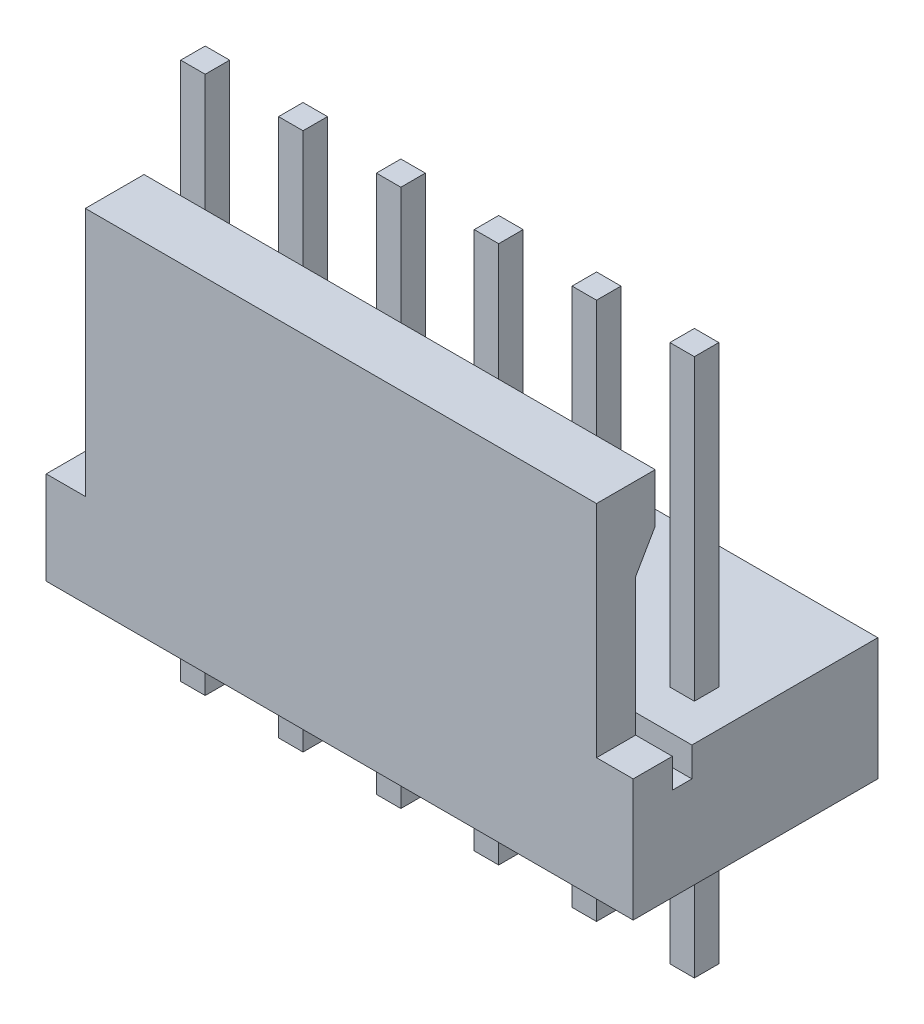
ISO-10303-21;
HEADER;
FILE_DESCRIPTION(('STEP AP214'),'2;1');
FILE_NAME('part.step','',(''),(''),'','','');
FILE_SCHEMA(('AUTOMOTIVE_DESIGN { 1 0 10303 214 1 1 1 1 }'));
ENDSEC;
DATA;
#1=APPLICATION_CONTEXT('core data for automotive mechanical design processes');
#2=APPLICATION_PROTOCOL_DEFINITION('international standard','automotive_design',2000,#1);
#3=PRODUCT_CONTEXT('',#1,'mechanical');
#4=PRODUCT('Part','Part','',(#3));
#5=PRODUCT_RELATED_PRODUCT_CATEGORY('part','',(#4));
#6=PRODUCT_DEFINITION_FORMATION('','',#4);
#7=PRODUCT_DEFINITION_CONTEXT('part definition',#1,'design');
#8=PRODUCT_DEFINITION('design','',#6,#7);
#9=PRODUCT_DEFINITION_SHAPE('','',#8);
#10=(LENGTH_UNIT() NAMED_UNIT(*) SI_UNIT(.MILLI.,.METRE.));
#11=(NAMED_UNIT(*) PLANE_ANGLE_UNIT() SI_UNIT($,.RADIAN.));
#12=(NAMED_UNIT(*) SI_UNIT($,.STERADIAN.) SOLID_ANGLE_UNIT());
#13=UNCERTAINTY_MEASURE_WITH_UNIT(LENGTH_MEASURE(1.E-05),#10,'distance_accuracy_value','');
#14=(GEOMETRIC_REPRESENTATION_CONTEXT(3) GLOBAL_UNCERTAINTY_ASSIGNED_CONTEXT((#13)) GLOBAL_UNIT_ASSIGNED_CONTEXT((#10,
#11,#12)) REPRESENTATION_CONTEXT('',''));
#15=CARTESIAN_POINT('',(0.,0.,0.));
#16=DIRECTION('',(0.,0.,1.));
#17=DIRECTION('',(1.,0.,0.));
#18=AXIS2_PLACEMENT_3D('',#15,#16,#17);
#19=CARTESIAN_POINT('',(18.04924,8.23765582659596,-51.800721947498));
#20=DIRECTION('',(0.,-0.500000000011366,-0.866025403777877));
#21=DIRECTION('',(0.,0.866025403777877,-0.500000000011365));
#22=AXIS2_PLACEMENT_3D('',#19,#20,#21);
#23=PLANE('',#22);
#24=DIRECTION('',(-1.,0.,0.));
#25=VECTOR('',#24,1.);
#26=CARTESIAN_POINT('',(27.559,9.14400000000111,-52.324));
#27=LINE('',#26,#25);
#28=CARTESIAN_POINT('',(31.686499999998,9.14400000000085,-52.324));
#29=VERTEX_POINT('',#28);
#30=CARTESIAN_POINT('',(18.415,9.14400000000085,-52.3240000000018));
#31=VERTEX_POINT('',#30);
#32=EDGE_CURVE('E913',#29,#31,#27,.T.);
#33=ORIENTED_EDGE('',*,*,#32,.F.);
#34=DIRECTION('',(0.,-0.866025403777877,0.500000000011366));
#35=VECTOR('',#34,1.);
#36=CARTESIAN_POINT('',(31.686499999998,8.23765582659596,-51.800721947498));
#37=LINE('',#36,#35);
#38=CARTESIAN_POINT('',(31.686499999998,8.2641181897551,-51.8159999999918));
#39=VERTEX_POINT('',#38);
#40=EDGE_CURVE('E483',#29,#39,#37,.T.);
#41=ORIENTED_EDGE('',*,*,#40,.T.);
#42=DIRECTION('',(1.,0.,0.));
#43=VECTOR('',#42,1.);
#44=CARTESIAN_POINT('',(27.559,8.26411818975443,-51.816));
#45=LINE('',#44,#43);
#46=CARTESIAN_POINT('',(18.415,8.2641181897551,-51.8159999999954));
#47=VERTEX_POINT('',#46);
#48=EDGE_CURVE('E482',#47,#39,#45,.T.);
#49=ORIENTED_EDGE('',*,*,#48,.F.);
#50=DIRECTION('',(0.,0.866025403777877,-0.500000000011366));
#51=VECTOR('',#50,1.);
#52=CARTESIAN_POINT('',(18.415,8.70405909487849,-52.07));
#53=LINE('',#52,#51);
#54=EDGE_CURVE('E500',#47,#31,#53,.T.);
#55=ORIENTED_EDGE('',*,*,#54,.T.);
#56=EDGE_LOOP('',(#33,#41,#49,#55));
#57=FACE_BOUND('',#56,.T.);
#58=ADVANCED_FACE('F38',(#57),#23,.T.);
#59=CARTESIAN_POINT('',(18.04924,3.8504576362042,-51.816));
#60=DIRECTION('',(0.,0.,-1.));
#61=DIRECTION('',(0.,1.,0.));
#62=AXIS2_PLACEMENT_3D('',#59,#60,#61);
#63=PLANE('',#62);
#64=ORIENTED_EDGE('',*,*,#48,.T.);
#65=DIRECTION('',(0.,-1.,0.));
#66=VECTOR('',#65,1.);
#67=CARTESIAN_POINT('',(31.686499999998,3.8504576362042,-51.816));
#68=LINE('',#67,#66);
#69=CARTESIAN_POINT('',(31.686499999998,4.699,-51.816));
#70=VERTEX_POINT('',#69);
#71=EDGE_CURVE('E474',#39,#70,#68,.T.);
#72=ORIENTED_EDGE('',*,*,#71,.T.);
#73=DIRECTION('',(1.,0.,0.));
#74=VECTOR('',#73,1.);
#75=CARTESIAN_POINT('',(18.04924,4.699,-51.816));
#76=LINE('',#75,#74);
#77=CARTESIAN_POINT('',(32.6389999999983,4.699,-51.8159999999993));
#78=VERTEX_POINT('',#77);
#79=EDGE_CURVE('E462',#70,#78,#76,.T.);
#80=ORIENTED_EDGE('',*,*,#79,.T.);
#81=DIRECTION('',(0.,1.,0.));
#82=VECTOR('',#81,1.);
#83=CARTESIAN_POINT('',(32.6389999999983,3.8504576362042,-51.816));
#84=LINE('',#83,#82);
#85=CARTESIAN_POINT('',(32.6389999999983,3.937,-51.8159999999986));
#86=VERTEX_POINT('',#85);
#87=EDGE_CURVE('E498',#86,#78,#84,.T.);
#88=ORIENTED_EDGE('',*,*,#87,.F.);
#89=DIRECTION('',(1.,0.,0.));
#90=VECTOR('',#89,1.);
#91=CARTESIAN_POINT('',(27.559,3.937,-51.8159999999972));
#92=LINE('',#91,#90);
#93=CARTESIAN_POINT('',(18.415,3.93699999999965,-51.8159999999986));
#94=VERTEX_POINT('',#93);
#95=EDGE_CURVE('E808',#94,#86,#92,.T.);
#96=ORIENTED_EDGE('',*,*,#95,.F.);
#97=DIRECTION('',(0.,-1.,0.));
#98=VECTOR('',#97,1.);
#99=CARTESIAN_POINT('',(18.415,7.1755,-51.8159999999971));
#100=LINE('',#99,#98);
#101=EDGE_CURVE('E694',#47,#94,#100,.T.);
#102=ORIENTED_EDGE('',*,*,#101,.F.);
#103=EDGE_LOOP('',(#64,#72,#80,#88,#96,#102));
#104=FACE_BOUND('',#103,.T.);
#105=ADVANCED_FACE('F479',(#104),#63,.T.);
#106=CARTESIAN_POINT('',(18.04924,9.11344389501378,-52.324));
#107=DIRECTION('',(0.,0.,-1.));
#108=DIRECTION('',(0.,1.,0.));
#109=AXIS2_PLACEMENT_3D('',#106,#107,#108);
#110=PLANE('',#109);
#111=DIRECTION('',(-1.,0.,0.));
#112=VECTOR('',#111,1.);
#113=CARTESIAN_POINT('',(27.559,10.414,-52.3239999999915));
#114=LINE('',#113,#112);
#115=CARTESIAN_POINT('',(31.686499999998,10.414,-52.3239999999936));
#116=VERTEX_POINT('',#115);
#117=CARTESIAN_POINT('',(18.415,10.4139999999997,-52.3239999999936));
#118=VERTEX_POINT('',#117);
#119=EDGE_CURVE('E683',#116,#118,#114,.T.);
#120=ORIENTED_EDGE('',*,*,#119,.F.);
#121=DIRECTION('',(0.,-1.,0.));
#122=VECTOR('',#121,1.);
#123=CARTESIAN_POINT('',(31.686499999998,9.11344389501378,-52.324));
#124=LINE('',#123,#122);
#125=EDGE_CURVE('E487',#116,#29,#124,.T.);
#126=ORIENTED_EDGE('',*,*,#125,.T.);
#127=ORIENTED_EDGE('',*,*,#32,.T.);
#128=DIRECTION('',(0.,-1.,0.));
#129=VECTOR('',#128,1.);
#130=CARTESIAN_POINT('',(18.415,7.1755,-52.3239999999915));
#131=LINE('',#130,#129);
#132=EDGE_CURVE('E688',#118,#31,#131,.T.);
#133=ORIENTED_EDGE('',*,*,#132,.F.);
#134=EDGE_LOOP('',(#120,#126,#127,#133));
#135=FACE_BOUND('',#134,.T.);
#136=ADVANCED_FACE('F987',(#135),#110,.T.);
#137=CARTESIAN_POINT('',(18.04924,10.414,-52.3545561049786));
#138=DIRECTION('',(0.,1.,0.));
#139=DIRECTION('',(0.,0.,1.));
#140=AXIS2_PLACEMENT_3D('',#137,#138,#139);
#141=PLANE('',#140);
#142=DIRECTION('',(-1.,0.,0.));
#143=VECTOR('',#142,1.);
#144=CARTESIAN_POINT('',(27.559,10.414,-50.8));
#145=LINE('',#144,#143);
#146=CARTESIAN_POINT('',(31.686499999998,10.414,-50.8));
#147=VERTEX_POINT('',#146);
#148=CARTESIAN_POINT('',(18.415,10.414,-50.8000000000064));
#149=VERTEX_POINT('',#148);
#150=EDGE_CURVE('E563',#147,#149,#145,.T.);
#151=ORIENTED_EDGE('',*,*,#150,.F.);
#152=DIRECTION('',(0.,0.,-1.));
#153=VECTOR('',#152,1.);
#154=CARTESIAN_POINT('',(31.686499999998,10.414,-52.3545561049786));
#155=LINE('',#154,#153);
#156=EDGE_CURVE('E991',#147,#116,#155,.T.);
#157=ORIENTED_EDGE('',*,*,#156,.T.);
#158=ORIENTED_EDGE('',*,*,#119,.T.);
#159=DIRECTION('',(0.,0.,1.));
#160=VECTOR('',#159,1.);
#161=CARTESIAN_POINT('',(18.415,10.414,-51.562));
#162=LINE('',#161,#160);
#163=EDGE_CURVE('E685',#118,#149,#162,.T.);
#164=ORIENTED_EDGE('',*,*,#163,.T.);
#165=EDGE_LOOP('',(#151,#157,#158,#164));
#166=FACE_BOUND('',#165,.T.);
#167=ADVANCED_FACE('F983',(#166),#141,.T.);
#168=CARTESIAN_POINT('',(16.9926,10.5918,-50.8));
#169=DIRECTION('',(0.,0.,1.));
#170=DIRECTION('',(0.,-1.,0.));
#171=AXIS2_PLACEMENT_3D('',#168,#169,#170);
#172=PLANE('',#171);
#173=DIRECTION('',(-1.,0.,0.));
#174=VECTOR('',#173,1.);
#175=CARTESIAN_POINT('',(16.9926,4.699,-50.8));
#176=LINE('',#175,#174);
#177=CARTESIAN_POINT('',(32.6389999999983,4.699,-50.8));
#178=VERTEX_POINT('',#177);
#179=CARTESIAN_POINT('',(31.686499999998,4.699,-50.8));
#180=VERTEX_POINT('',#179);
#181=EDGE_CURVE('E52',#178,#180,#176,.T.);
#182=ORIENTED_EDGE('',*,*,#181,.T.);
#183=DIRECTION('',(0.,1.,0.));
#184=VECTOR('',#183,1.);
#185=CARTESIAN_POINT('',(31.686499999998,10.5918,-50.8));
#186=LINE('',#185,#184);
#187=EDGE_CURVE('E470',#180,#147,#186,.T.);
#188=ORIENTED_EDGE('',*,*,#187,.T.);
#189=ORIENTED_EDGE('',*,*,#150,.T.);
#190=DIRECTION('',(0.,-1.,0.));
#191=VECTOR('',#190,1.);
#192=CARTESIAN_POINT('',(18.415,5.969,-50.8));
#193=LINE('',#192,#191);
#194=CARTESIAN_POINT('',(18.415,3.937,-50.8000000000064));
#195=VERTEX_POINT('',#194);
#196=EDGE_CURVE('E565',#149,#195,#193,.T.);
#197=ORIENTED_EDGE('',*,*,#196,.T.);
#198=DIRECTION('',(1.,0.,0.));
#199=VECTOR('',#198,1.);
#200=CARTESIAN_POINT('',(27.559,3.937,-50.8000000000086));
#201=LINE('',#200,#199);
#202=CARTESIAN_POINT('',(17.399,3.937,-50.8000000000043));
#203=VERTEX_POINT('',#202);
#204=EDGE_CURVE('E804',#203,#195,#201,.T.);
#205=ORIENTED_EDGE('',*,*,#204,.F.);
#206=DIRECTION('',(0.,-1.,0.));
#207=VECTOR('',#206,1.);
#208=CARTESIAN_POINT('',(17.399,3.1115,-50.8));
#209=LINE('',#208,#207);
#210=CARTESIAN_POINT('',(17.399,1.524,-50.8));
#211=VERTEX_POINT('',#210);
#212=EDGE_CURVE('E510',#203,#211,#209,.T.);
#213=ORIENTED_EDGE('',*,*,#212,.T.);
#214=DIRECTION('',(-1.,0.,0.));
#215=VECTOR('',#214,1.);
#216=CARTESIAN_POINT('',(27.559,1.524,-50.8));
#217=LINE('',#216,#215);
#218=CARTESIAN_POINT('',(32.6389999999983,1.524,-50.8));
#219=VERTEX_POINT('',#218);
#220=EDGE_CURVE('E561',#219,#211,#217,.T.);
#221=ORIENTED_EDGE('',*,*,#220,.F.);
#222=DIRECTION('',(0.,-1.,0.));
#223=VECTOR('',#222,1.);
#224=CARTESIAN_POINT('',(32.6389999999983,10.5918,-50.8));
#225=LINE('',#224,#223);
#226=EDGE_CURVE('E492',#178,#219,#225,.T.);
#227=ORIENTED_EDGE('',*,*,#226,.F.);
#228=EDGE_LOOP('',(#182,#188,#189,#197,#205,#213,#221,#227));
#229=FACE_BOUND('',#228,.T.);
#230=ADVANCED_FACE('F979',(#229),#172,.T.);
#231=CARTESIAN_POINT('',(32.6389999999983,-1.524,-59.7215811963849));
#232=DIRECTION('',(-1.,0.,0.));
#233=DIRECTION('',(0.,0.,1.));
#234=AXIS2_PLACEMENT_3D('',#231,#232,#233);
#235=PLANE('',#234);
#236=DIRECTION('',(0.,0.,-1.));
#237=VECTOR('',#236,1.);
#238=CARTESIAN_POINT('',(32.6389999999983,4.699,-59.7215811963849));
#239=LINE('',#238,#237);
#240=EDGE_CURVE('E11',#178,#78,#239,.T.);
#241=ORIENTED_EDGE('',*,*,#240,.F.);
#242=ORIENTED_EDGE('',*,*,#226,.T.);
#243=DIRECTION('',(0.,0.,-1.));
#244=VECTOR('',#243,1.);
#245=CARTESIAN_POINT('',(32.6389999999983,1.524,-50.673));
#246=LINE('',#245,#244);
#247=CARTESIAN_POINT('',(32.6389999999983,1.524,-57.15));
#248=VERTEX_POINT('',#247);
#249=EDGE_CURVE('E485',#219,#248,#246,.T.);
#250=ORIENTED_EDGE('',*,*,#249,.T.);
#251=DIRECTION('',(0.,1.,0.));
#252=VECTOR('',#251,1.);
#253=CARTESIAN_POINT('',(32.6389999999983,1.4605,-57.15));
#254=LINE('',#253,#252);
#255=CARTESIAN_POINT('',(32.6389999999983,4.699,-57.15));
#256=VERTEX_POINT('',#255);
#257=EDGE_CURVE('E60',#248,#256,#254,.T.);
#258=ORIENTED_EDGE('',*,*,#257,.T.);
#259=DIRECTION('',(0.,0.,1.));
#260=VECTOR('',#259,1.);
#261=CARTESIAN_POINT('',(32.6389999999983,4.699,-57.24652));
#262=LINE('',#261,#260);
#263=CARTESIAN_POINT('',(32.6389999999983,4.699,-52.324));
#264=VERTEX_POINT('',#263);
#265=EDGE_CURVE('E46',#256,#264,#262,.T.);
#266=ORIENTED_EDGE('',*,*,#265,.T.);
#267=DIRECTION('',(0.,-1.,0.));
#268=VECTOR('',#267,1.);
#269=CARTESIAN_POINT('',(32.6389999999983,4.72955610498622,-52.324));
#270=LINE('',#269,#268);
#271=CARTESIAN_POINT('',(32.6389999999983,3.9370000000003,-52.324));
#272=VERTEX_POINT('',#271);
#273=EDGE_CURVE('E494',#264,#272,#270,.T.);
#274=ORIENTED_EDGE('',*,*,#273,.T.);
#275=DIRECTION('',(0.,0.,1.));
#276=VECTOR('',#275,1.);
#277=CARTESIAN_POINT('',(32.6389999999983,3.937,-52.3545561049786));
#278=LINE('',#277,#276);
#279=EDGE_CURVE('E496',#272,#86,#278,.T.);
#280=ORIENTED_EDGE('',*,*,#279,.T.);
#281=ORIENTED_EDGE('',*,*,#87,.T.);
#282=EDGE_LOOP('',(#241,#242,#250,#258,#266,#274,#280,#281));
#283=FACE_BOUND('',#282,.T.);
#284=ADVANCED_FACE('F959',(#283),#235,.F.);
#285=CARTESIAN_POINT('',(31.0209438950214,12.7254,-53.975));
#286=DIRECTION('',(0.,0.,-1.));
#287=DIRECTION('',(1.,0.,0.));
#288=AXIS2_PLACEMENT_3D('',#285,#286,#287);
#289=PLANE('',#288);
#290=DIRECTION('',(1.,0.,0.));
#291=VECTOR('',#290,1.);
#292=CARTESIAN_POINT('',(31.369,-1.524,-53.9749999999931));
#293=LINE('',#292,#291);
#294=CARTESIAN_POINT('',(31.0515000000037,-1.524,-53.9749999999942));
#295=VERTEX_POINT('',#294);
#296=CARTESIAN_POINT('',(31.6864999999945,-1.524,-53.9749999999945));
#297=VERTEX_POINT('',#296);
#298=EDGE_CURVE('E904',#295,#297,#293,.T.);
#299=ORIENTED_EDGE('',*,*,#298,.F.);
#300=DIRECTION('',(0.,-1.,0.));
#301=VECTOR('',#300,1.);
#302=CARTESIAN_POINT('',(31.0515,5.461,-53.9749999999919));
#303=LINE('',#302,#301);
#304=CARTESIAN_POINT('',(31.051500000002,1.524,-53.974999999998));
#305=VERTEX_POINT('',#304);
#306=EDGE_CURVE('E909',#305,#295,#303,.T.);
#307=ORIENTED_EDGE('',*,*,#306,.F.);
#308=DIRECTION('',(1.,0.,0.));
#309=VECTOR('',#308,1.);
#310=CARTESIAN_POINT('',(31.369,1.524,-53.975));
#311=LINE('',#310,#309);
#312=CARTESIAN_POINT('',(31.686499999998,1.524,-53.974999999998));
#313=VERTEX_POINT('',#312);
#314=EDGE_CURVE('E938',#305,#313,#311,.T.);
#315=ORIENTED_EDGE('',*,*,#314,.T.);
#316=DIRECTION('',(0.,1.,0.));
#317=VECTOR('',#316,1.);
#318=CARTESIAN_POINT('',(31.6865,5.461,-53.974999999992));
#319=LINE('',#318,#317);
#320=EDGE_CURVE('E896',#297,#313,#319,.T.);
#321=ORIENTED_EDGE('',*,*,#320,.F.);
#322=EDGE_LOOP('',(#299,#307,#315,#321));
#323=FACE_BOUND('',#322,.T.);
#324=ADVANCED_FACE('F1084',(#323),#289,.T.);
#325=CARTESIAN_POINT('',(28.4809438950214,12.7254,-53.975));
#326=DIRECTION('',(0.,0.,-1.));
#327=DIRECTION('',(1.,0.,0.));
#328=AXIS2_PLACEMENT_3D('',#325,#326,#327);
#329=PLANE('',#328);
#330=DIRECTION('',(1.,0.,0.));
#331=VECTOR('',#330,1.);
#332=CARTESIAN_POINT('',(28.829,-1.524,-53.9749999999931));
#333=LINE('',#332,#331);
#334=CARTESIAN_POINT('',(28.5115000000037,-1.524,-53.9749999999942));
#335=VERTEX_POINT('',#334);
#336=CARTESIAN_POINT('',(29.1464999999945,-1.524,-53.9749999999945));
#337=VERTEX_POINT('',#336);
#338=EDGE_CURVE('E887',#335,#337,#333,.T.);
#339=ORIENTED_EDGE('',*,*,#338,.F.);
#340=DIRECTION('',(0.,-1.,0.));
#341=VECTOR('',#340,1.);
#342=CARTESIAN_POINT('',(28.5115,5.461,-53.9749999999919));
#343=LINE('',#342,#341);
#344=CARTESIAN_POINT('',(28.511500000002,1.524,-53.974999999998));
#345=VERTEX_POINT('',#344);
#346=EDGE_CURVE('E892',#345,#335,#343,.T.);
#347=ORIENTED_EDGE('',*,*,#346,.F.);
#348=DIRECTION('',(1.,0.,0.));
#349=VECTOR('',#348,1.);
#350=CARTESIAN_POINT('',(28.829,1.524,-53.975));
#351=LINE('',#350,#349);
#352=CARTESIAN_POINT('',(29.146499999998,1.524,-53.974999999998));
#353=VERTEX_POINT('',#352);
#354=EDGE_CURVE('E936',#345,#353,#351,.T.);
#355=ORIENTED_EDGE('',*,*,#354,.T.);
#356=DIRECTION('',(0.,1.,0.));
#357=VECTOR('',#356,1.);
#358=CARTESIAN_POINT('',(29.1465,5.461,-53.974999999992));
#359=LINE('',#358,#357);
#360=EDGE_CURVE('E879',#337,#353,#359,.T.);
#361=ORIENTED_EDGE('',*,*,#360,.F.);
#362=EDGE_LOOP('',(#339,#347,#355,#361));
#363=FACE_BOUND('',#362,.T.);
#364=ADVANCED_FACE('F1087',(#363),#329,.T.);
#365=CARTESIAN_POINT('',(25.9409438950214,12.7254,-53.975));
#366=DIRECTION('',(0.,0.,-1.));
#367=DIRECTION('',(1.,0.,0.));
#368=AXIS2_PLACEMENT_3D('',#365,#366,#367);
#369=PLANE('',#368);
#370=DIRECTION('',(1.,0.,0.));
#371=VECTOR('',#370,1.);
#372=CARTESIAN_POINT('',(26.289,-1.524,-53.9749999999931));
#373=LINE('',#372,#371);
#374=CARTESIAN_POINT('',(25.9715000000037,-1.524,-53.9749999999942));
#375=VERTEX_POINT('',#374);
#376=CARTESIAN_POINT('',(26.6064999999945,-1.524,-53.9749999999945));
#377=VERTEX_POINT('',#376);
#378=EDGE_CURVE('E870',#375,#377,#373,.T.);
#379=ORIENTED_EDGE('',*,*,#378,.F.);
#380=DIRECTION('',(0.,-1.,0.));
#381=VECTOR('',#380,1.);
#382=CARTESIAN_POINT('',(25.9715,5.461,-53.9749999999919));
#383=LINE('',#382,#381);
#384=CARTESIAN_POINT('',(25.971500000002,1.524,-53.974999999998));
#385=VERTEX_POINT('',#384);
#386=EDGE_CURVE('E875',#385,#375,#383,.T.);
#387=ORIENTED_EDGE('',*,*,#386,.F.);
#388=DIRECTION('',(1.,0.,0.));
#389=VECTOR('',#388,1.);
#390=CARTESIAN_POINT('',(26.289,1.524,-53.975));
#391=LINE('',#390,#389);
#392=CARTESIAN_POINT('',(26.606499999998,1.524,-53.974999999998));
#393=VERTEX_POINT('',#392);
#394=EDGE_CURVE('E934',#385,#393,#391,.T.);
#395=ORIENTED_EDGE('',*,*,#394,.T.);
#396=DIRECTION('',(0.,1.,0.));
#397=VECTOR('',#396,1.);
#398=CARTESIAN_POINT('',(26.6065,5.461,-53.974999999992));
#399=LINE('',#398,#397);
#400=EDGE_CURVE('E862',#377,#393,#399,.T.);
#401=ORIENTED_EDGE('',*,*,#400,.F.);
#402=EDGE_LOOP('',(#379,#387,#395,#401));
#403=FACE_BOUND('',#402,.T.);
#404=ADVANCED_FACE('F1091',(#403),#369,.T.);
#405=CARTESIAN_POINT('',(23.4009438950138,12.7254,-53.975));
#406=DIRECTION('',(0.,0.,-1.));
#407=DIRECTION('',(1.,0.,0.));
#408=AXIS2_PLACEMENT_3D('',#405,#406,#407);
#409=PLANE('',#408);
#410=DIRECTION('',(1.,0.,0.));
#411=VECTOR('',#410,1.);
#412=CARTESIAN_POINT('',(23.749,-1.524,-53.9749999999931));
#413=LINE('',#412,#411);
#414=CARTESIAN_POINT('',(23.4315000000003,-1.524,-53.9749999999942));
#415=VERTEX_POINT('',#414);
#416=CARTESIAN_POINT('',(24.0664999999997,-1.524,-53.9749999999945));
#417=VERTEX_POINT('',#416);
#418=EDGE_CURVE('E853',#415,#417,#413,.T.);
#419=ORIENTED_EDGE('',*,*,#418,.F.);
#420=DIRECTION('',(0.,-1.,0.));
#421=VECTOR('',#420,1.);
#422=CARTESIAN_POINT('',(23.4315,5.461,-53.9749999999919));
#423=LINE('',#422,#421);
#424=CARTESIAN_POINT('',(23.4315000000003,1.524,-53.974999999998));
#425=VERTEX_POINT('',#424);
#426=EDGE_CURVE('E858',#425,#415,#423,.T.);
#427=ORIENTED_EDGE('',*,*,#426,.F.);
#428=DIRECTION('',(1.,0.,0.));
#429=VECTOR('',#428,1.);
#430=CARTESIAN_POINT('',(23.749,1.524,-53.975));
#431=LINE('',#430,#429);
#432=CARTESIAN_POINT('',(24.0664999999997,1.524,-53.974999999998));
#433=VERTEX_POINT('',#432);
#434=EDGE_CURVE('E932',#425,#433,#431,.T.);
#435=ORIENTED_EDGE('',*,*,#434,.T.);
#436=DIRECTION('',(0.,1.,0.));
#437=VECTOR('',#436,1.);
#438=CARTESIAN_POINT('',(24.0665,5.461,-53.974999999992));
#439=LINE('',#438,#437);
#440=EDGE_CURVE('E845',#417,#433,#439,.T.);
#441=ORIENTED_EDGE('',*,*,#440,.F.);
#442=EDGE_LOOP('',(#419,#427,#435,#441));
#443=FACE_BOUND('',#442,.T.);
#444=ADVANCED_FACE('F1095',(#443),#409,.T.);
#445=CARTESIAN_POINT('',(20.8609438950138,12.7254,-53.975));
#446=DIRECTION('',(0.,0.,-1.));
#447=DIRECTION('',(1.,0.,0.));
#448=AXIS2_PLACEMENT_3D('',#445,#446,#447);
#449=PLANE('',#448);
#450=DIRECTION('',(1.,0.,0.));
#451=VECTOR('',#450,1.);
#452=CARTESIAN_POINT('',(21.209,-1.524,-53.9749999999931));
#453=LINE('',#452,#451);
#454=CARTESIAN_POINT('',(20.8915000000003,-1.524,-53.9749999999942));
#455=VERTEX_POINT('',#454);
#456=CARTESIAN_POINT('',(21.5264999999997,-1.524,-53.9749999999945));
#457=VERTEX_POINT('',#456);
#458=EDGE_CURVE('E836',#455,#457,#453,.T.);
#459=ORIENTED_EDGE('',*,*,#458,.F.);
#460=DIRECTION('',(0.,-1.,0.));
#461=VECTOR('',#460,1.);
#462=CARTESIAN_POINT('',(20.8915,5.461,-53.9749999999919));
#463=LINE('',#462,#461);
#464=CARTESIAN_POINT('',(20.8915000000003,1.524,-53.974999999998));
#465=VERTEX_POINT('',#464);
#466=EDGE_CURVE('E841',#465,#455,#463,.T.);
#467=ORIENTED_EDGE('',*,*,#466,.F.);
#468=DIRECTION('',(1.,0.,0.));
#469=VECTOR('',#468,1.);
#470=CARTESIAN_POINT('',(21.209,1.524,-53.975));
#471=LINE('',#470,#469);
#472=CARTESIAN_POINT('',(21.5264999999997,1.524,-53.974999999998));
#473=VERTEX_POINT('',#472);
#474=EDGE_CURVE('E930',#465,#473,#471,.T.);
#475=ORIENTED_EDGE('',*,*,#474,.T.);
#476=DIRECTION('',(0.,1.,0.));
#477=VECTOR('',#476,1.);
#478=CARTESIAN_POINT('',(21.5265,5.461,-53.974999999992));
#479=LINE('',#478,#477);
#480=EDGE_CURVE('E828',#457,#473,#479,.T.);
#481=ORIENTED_EDGE('',*,*,#480,.F.);
#482=EDGE_LOOP('',(#459,#467,#475,#481));
#483=FACE_BOUND('',#482,.T.);
#484=ADVANCED_FACE('F1099',(#483),#449,.T.);
#485=CARTESIAN_POINT('',(18.3209438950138,12.7254,-53.975));
#486=DIRECTION('',(0.,0.,-1.));
#487=DIRECTION('',(1.,0.,0.));
#488=AXIS2_PLACEMENT_3D('',#485,#486,#487);
#489=PLANE('',#488);
#490=DIRECTION('',(1.,0.,0.));
#491=VECTOR('',#490,1.);
#492=CARTESIAN_POINT('',(18.669,-1.524,-53.9749999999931));
#493=LINE('',#492,#491);
#494=CARTESIAN_POINT('',(18.3515000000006,-1.524,-53.9749999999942));
#495=VERTEX_POINT('',#494);
#496=CARTESIAN_POINT('',(18.9864999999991,-1.524,-53.9749999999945));
#497=VERTEX_POINT('',#496);
#498=EDGE_CURVE('E819',#495,#497,#493,.T.);
#499=ORIENTED_EDGE('',*,*,#498,.F.);
#500=DIRECTION('',(0.,-1.,0.));
#501=VECTOR('',#500,1.);
#502=CARTESIAN_POINT('',(18.3515,5.461,-53.9749999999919));
#503=LINE('',#502,#501);
#504=CARTESIAN_POINT('',(18.3515000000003,1.524,-53.974999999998));
#505=VERTEX_POINT('',#504);
#506=EDGE_CURVE('E824',#505,#495,#503,.T.);
#507=ORIENTED_EDGE('',*,*,#506,.F.);
#508=DIRECTION('',(1.,0.,0.));
#509=VECTOR('',#508,1.);
#510=CARTESIAN_POINT('',(18.669,1.524,-53.975));
#511=LINE('',#510,#509);
#512=CARTESIAN_POINT('',(18.9864999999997,1.524,-53.974999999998));
#513=VERTEX_POINT('',#512);
#514=EDGE_CURVE('E928',#505,#513,#511,.T.);
#515=ORIENTED_EDGE('',*,*,#514,.T.);
#516=DIRECTION('',(0.,1.,0.));
#517=VECTOR('',#516,1.);
#518=CARTESIAN_POINT('',(18.9865,5.461,-53.974999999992));
#519=LINE('',#518,#517);
#520=EDGE_CURVE('E811',#497,#513,#519,.T.);
#521=ORIENTED_EDGE('',*,*,#520,.F.);
#522=EDGE_LOOP('',(#499,#507,#515,#521));
#523=FACE_BOUND('',#522,.T.);
#524=ADVANCED_FACE('F1103',(#523),#489,.T.);
#525=CARTESIAN_POINT('',(31.7170561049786,12.7254,-53.34));
#526=DIRECTION('',(0.,0.,1.));
#527=DIRECTION('',(-1.,0.,0.));
#528=AXIS2_PLACEMENT_3D('',#525,#526,#527);
#529=PLANE('',#528);
#530=DIRECTION('',(-1.,0.,0.));
#531=VECTOR('',#530,1.);
#532=CARTESIAN_POINT('',(31.369,12.446,-53.3400000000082));
#533=LINE('',#532,#531);
#534=CARTESIAN_POINT('',(31.6864999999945,12.446,-53.3400000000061));
#535=VERTEX_POINT('',#534);
#536=CARTESIAN_POINT('',(31.0515000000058,12.446,-53.3400000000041));
#537=VERTEX_POINT('',#536);
#538=EDGE_CURVE('E797',#535,#537,#533,.T.);
#539=ORIENTED_EDGE('',*,*,#538,.T.);
#540=DIRECTION('',(0.,1.,0.));
#541=VECTOR('',#540,1.);
#542=CARTESIAN_POINT('',(31.0515,5.461,-53.340000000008));
#543=LINE('',#542,#541);
#544=CARTESIAN_POINT('',(31.051500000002,4.699,-53.340000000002));
#545=VERTEX_POINT('',#544);
#546=EDGE_CURVE('E800',#545,#537,#543,.T.);
#547=ORIENTED_EDGE('',*,*,#546,.F.);
#548=DIRECTION('',(1.,0.,0.));
#549=VECTOR('',#548,1.);
#550=CARTESIAN_POINT('',(31.369,4.699,-53.34));
#551=LINE('',#550,#549);
#552=CARTESIAN_POINT('',(31.686499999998,4.699,-53.340000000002));
#553=VERTEX_POINT('',#552);
#554=EDGE_CURVE('E926',#545,#553,#551,.T.);
#555=ORIENTED_EDGE('',*,*,#554,.T.);
#556=DIRECTION('',(0.,-1.,0.));
#557=VECTOR('',#556,1.);
#558=CARTESIAN_POINT('',(31.6865,5.461,-53.3400000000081));
#559=LINE('',#558,#557);
#560=EDGE_CURVE('E786',#535,#553,#559,.T.);
#561=ORIENTED_EDGE('',*,*,#560,.F.);
#562=EDGE_LOOP('',(#539,#547,#555,#561));
#563=FACE_BOUND('',#562,.T.);
#564=ADVANCED_FACE('F1107',(#563),#529,.T.);
#565=CARTESIAN_POINT('',(29.1770561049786,12.7254,-53.34));
#566=DIRECTION('',(0.,0.,1.));
#567=DIRECTION('',(-1.,0.,0.));
#568=AXIS2_PLACEMENT_3D('',#565,#566,#567);
#569=PLANE('',#568);
#570=DIRECTION('',(-1.,0.,0.));
#571=VECTOR('',#570,1.);
#572=CARTESIAN_POINT('',(28.829,12.446,-53.3400000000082));
#573=LINE('',#572,#571);
#574=CARTESIAN_POINT('',(29.1464999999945,12.446,-53.3400000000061));
#575=VERTEX_POINT('',#574);
#576=CARTESIAN_POINT('',(28.5115000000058,12.446,-53.3400000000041));
#577=VERTEX_POINT('',#576);
#578=EDGE_CURVE('E779',#575,#577,#573,.T.);
#579=ORIENTED_EDGE('',*,*,#578,.T.);
#580=DIRECTION('',(0.,1.,0.));
#581=VECTOR('',#580,1.);
#582=CARTESIAN_POINT('',(28.5115,5.461,-53.340000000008));
#583=LINE('',#582,#581);
#584=CARTESIAN_POINT('',(28.511500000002,4.699,-53.340000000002));
#585=VERTEX_POINT('',#584);
#586=EDGE_CURVE('E782',#585,#577,#583,.T.);
#587=ORIENTED_EDGE('',*,*,#586,.F.);
#588=DIRECTION('',(1.,0.,0.));
#589=VECTOR('',#588,1.);
#590=CARTESIAN_POINT('',(28.829,4.699,-53.34));
#591=LINE('',#590,#589);
#592=CARTESIAN_POINT('',(29.146499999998,4.699,-53.340000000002));
#593=VERTEX_POINT('',#592);
#594=EDGE_CURVE('E924',#585,#593,#591,.T.);
#595=ORIENTED_EDGE('',*,*,#594,.T.);
#596=DIRECTION('',(0.,-1.,0.));
#597=VECTOR('',#596,1.);
#598=CARTESIAN_POINT('',(29.1465,5.461,-53.3400000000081));
#599=LINE('',#598,#597);
#600=EDGE_CURVE('E768',#575,#593,#599,.T.);
#601=ORIENTED_EDGE('',*,*,#600,.F.);
#602=EDGE_LOOP('',(#579,#587,#595,#601));
#603=FACE_BOUND('',#602,.T.);
#604=ADVANCED_FACE('F1111',(#603),#569,.T.);
#605=CARTESIAN_POINT('',(26.6370561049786,12.7254,-53.34));
#606=DIRECTION('',(0.,0.,1.));
#607=DIRECTION('',(-1.,0.,0.));
#608=AXIS2_PLACEMENT_3D('',#605,#606,#607);
#609=PLANE('',#608);
#610=DIRECTION('',(-1.,0.,0.));
#611=VECTOR('',#610,1.);
#612=CARTESIAN_POINT('',(26.289,12.446,-53.3400000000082));
#613=LINE('',#612,#611);
#614=CARTESIAN_POINT('',(26.6064999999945,12.446,-53.3400000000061));
#615=VERTEX_POINT('',#614);
#616=CARTESIAN_POINT('',(25.9715000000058,12.446,-53.3400000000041));
#617=VERTEX_POINT('',#616);
#618=EDGE_CURVE('E761',#615,#617,#613,.T.);
#619=ORIENTED_EDGE('',*,*,#618,.T.);
#620=DIRECTION('',(0.,1.,0.));
#621=VECTOR('',#620,1.);
#622=CARTESIAN_POINT('',(25.9715,5.461,-53.340000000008));
#623=LINE('',#622,#621);
#624=CARTESIAN_POINT('',(25.971500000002,4.699,-53.340000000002));
#625=VERTEX_POINT('',#624);
#626=EDGE_CURVE('E764',#625,#617,#623,.T.);
#627=ORIENTED_EDGE('',*,*,#626,.F.);
#628=DIRECTION('',(1.,0.,0.));
#629=VECTOR('',#628,1.);
#630=CARTESIAN_POINT('',(26.289,4.699,-53.34));
#631=LINE('',#630,#629);
#632=CARTESIAN_POINT('',(26.606499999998,4.699,-53.340000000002));
#633=VERTEX_POINT('',#632);
#634=EDGE_CURVE('E922',#625,#633,#631,.T.);
#635=ORIENTED_EDGE('',*,*,#634,.T.);
#636=DIRECTION('',(0.,-1.,0.));
#637=VECTOR('',#636,1.);
#638=CARTESIAN_POINT('',(26.6065,5.461,-53.3400000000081));
#639=LINE('',#638,#637);
#640=EDGE_CURVE('E750',#615,#633,#639,.T.);
#641=ORIENTED_EDGE('',*,*,#640,.F.);
#642=EDGE_LOOP('',(#619,#627,#635,#641));
#643=FACE_BOUND('',#642,.T.);
#644=ADVANCED_FACE('F1115',(#643),#609,.T.);
#645=CARTESIAN_POINT('',(24.0970561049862,12.7254,-53.34));
#646=DIRECTION('',(0.,0.,1.));
#647=DIRECTION('',(-1.,0.,0.));
#648=AXIS2_PLACEMENT_3D('',#645,#646,#647);
#649=PLANE('',#648);
#650=DIRECTION('',(-1.,0.,0.));
#651=VECTOR('',#650,1.);
#652=CARTESIAN_POINT('',(23.749,12.446,-53.3400000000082));
#653=LINE('',#652,#651);
#654=CARTESIAN_POINT('',(24.0664999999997,12.446,-53.3400000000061));
#655=VERTEX_POINT('',#654);
#656=CARTESIAN_POINT('',(23.4315000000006,12.446,-53.3400000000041));
#657=VERTEX_POINT('',#656);
#658=EDGE_CURVE('E743',#655,#657,#653,.T.);
#659=ORIENTED_EDGE('',*,*,#658,.T.);
#660=DIRECTION('',(0.,1.,0.));
#661=VECTOR('',#660,1.);
#662=CARTESIAN_POINT('',(23.4315,5.461,-53.340000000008));
#663=LINE('',#662,#661);
#664=CARTESIAN_POINT('',(23.4315000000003,4.699,-53.340000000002));
#665=VERTEX_POINT('',#664);
#666=EDGE_CURVE('E746',#665,#657,#663,.T.);
#667=ORIENTED_EDGE('',*,*,#666,.F.);
#668=DIRECTION('',(1.,0.,0.));
#669=VECTOR('',#668,1.);
#670=CARTESIAN_POINT('',(23.749,4.699,-53.34));
#671=LINE('',#670,#669);
#672=CARTESIAN_POINT('',(24.0664999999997,4.699,-53.340000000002));
#673=VERTEX_POINT('',#672);
#674=EDGE_CURVE('E920',#665,#673,#671,.T.);
#675=ORIENTED_EDGE('',*,*,#674,.T.);
#676=DIRECTION('',(0.,-1.,0.));
#677=VECTOR('',#676,1.);
#678=CARTESIAN_POINT('',(24.0665,5.461,-53.3400000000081));
#679=LINE('',#678,#677);
#680=EDGE_CURVE('E732',#655,#673,#679,.T.);
#681=ORIENTED_EDGE('',*,*,#680,.F.);
#682=EDGE_LOOP('',(#659,#667,#675,#681));
#683=FACE_BOUND('',#682,.T.);
#684=ADVANCED_FACE('F1119',(#683),#649,.T.);
#685=CARTESIAN_POINT('',(21.5570561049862,12.7254,-53.34));
#686=DIRECTION('',(0.,0.,1.));
#687=DIRECTION('',(-1.,0.,0.));
#688=AXIS2_PLACEMENT_3D('',#685,#686,#687);
#689=PLANE('',#688);
#690=DIRECTION('',(-1.,0.,0.));
#691=VECTOR('',#690,1.);
#692=CARTESIAN_POINT('',(21.209,12.446,-53.3400000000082));
#693=LINE('',#692,#691);
#694=CARTESIAN_POINT('',(21.5264999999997,12.446,-53.3400000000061));
#695=VERTEX_POINT('',#694);
#696=CARTESIAN_POINT('',(20.8915000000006,12.446,-53.3400000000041));
#697=VERTEX_POINT('',#696);
#698=EDGE_CURVE('E725',#695,#697,#693,.T.);
#699=ORIENTED_EDGE('',*,*,#698,.T.);
#700=DIRECTION('',(0.,1.,0.));
#701=VECTOR('',#700,1.);
#702=CARTESIAN_POINT('',(20.8915,5.461,-53.340000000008));
#703=LINE('',#702,#701);
#704=CARTESIAN_POINT('',(20.8915000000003,4.699,-53.340000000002));
#705=VERTEX_POINT('',#704);
#706=EDGE_CURVE('E728',#705,#697,#703,.T.);
#707=ORIENTED_EDGE('',*,*,#706,.F.);
#708=DIRECTION('',(1.,0.,0.));
#709=VECTOR('',#708,1.);
#710=CARTESIAN_POINT('',(21.209,4.699,-53.34));
#711=LINE('',#710,#709);
#712=CARTESIAN_POINT('',(21.5264999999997,4.699,-53.340000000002));
#713=VERTEX_POINT('',#712);
#714=EDGE_CURVE('E918',#705,#713,#711,.T.);
#715=ORIENTED_EDGE('',*,*,#714,.T.);
#716=DIRECTION('',(0.,-1.,0.));
#717=VECTOR('',#716,1.);
#718=CARTESIAN_POINT('',(21.5265,5.461,-53.3400000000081));
#719=LINE('',#718,#717);
#720=EDGE_CURVE('E714',#695,#713,#719,.T.);
#721=ORIENTED_EDGE('',*,*,#720,.F.);
#722=EDGE_LOOP('',(#699,#707,#715,#721));
#723=FACE_BOUND('',#722,.T.);
#724=ADVANCED_FACE('F1123',(#723),#689,.T.);
#725=CARTESIAN_POINT('',(19.0170561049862,12.7254,-53.34));
#726=DIRECTION('',(0.,0.,1.));
#727=DIRECTION('',(-1.,0.,0.));
#728=AXIS2_PLACEMENT_3D('',#725,#726,#727);
#729=PLANE('',#728);
#730=DIRECTION('',(-1.,0.,0.));
#731=VECTOR('',#730,1.);
#732=CARTESIAN_POINT('',(18.669,12.446,-53.3400000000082));
#733=LINE('',#732,#731);
#734=CARTESIAN_POINT('',(18.9864999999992,12.446,-53.3400000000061));
#735=VERTEX_POINT('',#734);
#736=CARTESIAN_POINT('',(18.3515000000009,12.446,-53.3400000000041));
#737=VERTEX_POINT('',#736);
#738=EDGE_CURVE('E707',#735,#737,#733,.T.);
#739=ORIENTED_EDGE('',*,*,#738,.T.);
#740=DIRECTION('',(0.,1.,0.));
#741=VECTOR('',#740,1.);
#742=CARTESIAN_POINT('',(18.3515,5.461,-53.340000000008));
#743=LINE('',#742,#741);
#744=CARTESIAN_POINT('',(18.3515000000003,4.699,-53.340000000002));
#745=VERTEX_POINT('',#744);
#746=EDGE_CURVE('E710',#745,#737,#743,.T.);
#747=ORIENTED_EDGE('',*,*,#746,.F.);
#748=DIRECTION('',(1.,0.,0.));
#749=VECTOR('',#748,1.);
#750=CARTESIAN_POINT('',(18.669,4.699,-53.34));
#751=LINE('',#750,#749);
#752=CARTESIAN_POINT('',(18.9864999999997,4.699,-53.340000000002));
#753=VERTEX_POINT('',#752);
#754=EDGE_CURVE('E916',#745,#753,#751,.T.);
#755=ORIENTED_EDGE('',*,*,#754,.T.);
#756=DIRECTION('',(0.,-1.,0.));
#757=VECTOR('',#756,1.);
#758=CARTESIAN_POINT('',(18.9865,5.461,-53.3400000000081));
#759=LINE('',#758,#757);
#760=EDGE_CURVE('E696',#735,#753,#759,.T.);
#761=ORIENTED_EDGE('',*,*,#760,.F.);
#762=EDGE_LOOP('',(#739,#747,#755,#761));
#763=FACE_BOUND('',#762,.T.);
#764=ADVANCED_FACE('F1127',(#763),#729,.T.);
#765=CARTESIAN_POINT('',(31.0515,12.7254,-53.3094438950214));
#766=DIRECTION('',(-1.,0.,0.));
#767=DIRECTION('',(0.,0.,-1.));
#768=AXIS2_PLACEMENT_3D('',#765,#766,#767);
#769=PLANE('',#768);
#770=DIRECTION('',(0.,0.,-1.));
#771=VECTOR('',#770,1.);
#772=CARTESIAN_POINT('',(31.051500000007,-1.524,-53.6575));
#773=LINE('',#772,#771);
#774=CARTESIAN_POINT('',(31.0515000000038,-1.524,-53.3400000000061));
#775=VERTEX_POINT('',#774);
#776=EDGE_CURVE('E906',#775,#295,#773,.T.);
#777=ORIENTED_EDGE('',*,*,#776,.F.);
#778=DIRECTION('',(0.,-1.,0.));
#779=VECTOR('',#778,1.);
#780=CARTESIAN_POINT('',(31.0515000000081,5.461,-53.34));
#781=LINE('',#780,#779);
#782=CARTESIAN_POINT('',(31.051500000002,1.524,-53.340000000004));
#783=VERTEX_POINT('',#782);
#784=EDGE_CURVE('E681',#783,#775,#781,.T.);
#785=ORIENTED_EDGE('',*,*,#784,.F.);
#786=DIRECTION('',(0.,0.,-1.));
#787=VECTOR('',#786,1.);
#788=CARTESIAN_POINT('',(31.0515,1.524,-53.6575));
#789=LINE('',#788,#787);
#790=EDGE_CURVE('E911',#783,#305,#789,.T.);
#791=ORIENTED_EDGE('',*,*,#790,.T.);
#792=ORIENTED_EDGE('',*,*,#306,.T.);
#793=EDGE_LOOP('',(#777,#785,#791,#792));
#794=FACE_BOUND('',#793,.T.);
#795=ADVANCED_FACE('F1130',(#794),#769,.T.);
#796=CARTESIAN_POINT('',(31.7170561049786,-1.524,-53.3094438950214));
#797=DIRECTION('',(0.,-1.,0.));
#798=DIRECTION('',(-1.,0.,0.));
#799=AXIS2_PLACEMENT_3D('',#796,#797,#798);
#800=PLANE('',#799);
#801=ORIENTED_EDGE('',*,*,#776,.T.);
#802=ORIENTED_EDGE('',*,*,#298,.T.);
#803=DIRECTION('',(0.,0.,-1.));
#804=VECTOR('',#803,1.);
#805=CARTESIAN_POINT('',(31.6865,-1.524,-53.6575));
#806=LINE('',#805,#804);
#807=CARTESIAN_POINT('',(31.6864999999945,-1.524,-53.3400000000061));
#808=VERTEX_POINT('',#807);
#809=EDGE_CURVE('E899',#808,#297,#806,.T.);
#810=ORIENTED_EDGE('',*,*,#809,.F.);
#811=DIRECTION('',(1.,0.,0.));
#812=VECTOR('',#811,1.);
#813=CARTESIAN_POINT('',(31.369,-1.524,-53.34));
#814=LINE('',#813,#812);
#815=EDGE_CURVE('E679',#775,#808,#814,.T.);
#816=ORIENTED_EDGE('',*,*,#815,.F.);
#817=EDGE_LOOP('',(#801,#802,#810,#816));
#818=FACE_BOUND('',#817,.T.);
#819=ADVANCED_FACE('F1137',(#818),#800,.T.);
#820=CARTESIAN_POINT('',(31.6865,12.7254,-54.0055561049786));
#821=DIRECTION('',(1.,0.,0.));
#822=DIRECTION('',(0.,0.,1.));
#823=AXIS2_PLACEMENT_3D('',#820,#821,#822);
#824=PLANE('',#823);
#825=ORIENTED_EDGE('',*,*,#809,.T.);
#826=ORIENTED_EDGE('',*,*,#320,.T.);
#827=DIRECTION('',(0.,0.,1.));
#828=VECTOR('',#827,1.);
#829=CARTESIAN_POINT('',(31.6865,1.524,-53.6575));
#830=LINE('',#829,#828);
#831=CARTESIAN_POINT('',(31.686499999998,1.524,-53.3400000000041));
#832=VERTEX_POINT('',#831);
#833=EDGE_CURVE('E902',#313,#832,#830,.T.);
#834=ORIENTED_EDGE('',*,*,#833,.T.);
#835=DIRECTION('',(0.,1.,0.));
#836=VECTOR('',#835,1.);
#837=CARTESIAN_POINT('',(31.686499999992,5.461,-53.34));
#838=LINE('',#837,#836);
#839=EDGE_CURVE('E676',#808,#832,#838,.T.);
#840=ORIENTED_EDGE('',*,*,#839,.F.);
#841=EDGE_LOOP('',(#825,#826,#834,#840));
#842=FACE_BOUND('',#841,.T.);
#843=ADVANCED_FACE('F1141',(#842),#824,.T.);
#844=CARTESIAN_POINT('',(28.5115,12.7254,-53.3094438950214));
#845=DIRECTION('',(-1.,0.,0.));
#846=DIRECTION('',(0.,0.,-1.));
#847=AXIS2_PLACEMENT_3D('',#844,#845,#846);
#848=PLANE('',#847);
#849=DIRECTION('',(0.,0.,-1.));
#850=VECTOR('',#849,1.);
#851=CARTESIAN_POINT('',(28.511500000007,-1.524,-53.6575));
#852=LINE('',#851,#850);
#853=CARTESIAN_POINT('',(28.5115000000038,-1.524,-53.3400000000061));
#854=VERTEX_POINT('',#853);
#855=EDGE_CURVE('E889',#854,#335,#852,.T.);
#856=ORIENTED_EDGE('',*,*,#855,.F.);
#857=DIRECTION('',(0.,-1.,0.));
#858=VECTOR('',#857,1.);
#859=CARTESIAN_POINT('',(28.5115000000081,5.461,-53.34));
#860=LINE('',#859,#858);
#861=CARTESIAN_POINT('',(28.511500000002,1.524,-53.340000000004));
#862=VERTEX_POINT('',#861);
#863=EDGE_CURVE('E674',#862,#854,#860,.T.);
#864=ORIENTED_EDGE('',*,*,#863,.F.);
#865=DIRECTION('',(0.,0.,-1.));
#866=VECTOR('',#865,1.);
#867=CARTESIAN_POINT('',(28.5115,1.524,-53.6575));
#868=LINE('',#867,#866);
#869=EDGE_CURVE('E894',#862,#345,#868,.T.);
#870=ORIENTED_EDGE('',*,*,#869,.T.);
#871=ORIENTED_EDGE('',*,*,#346,.T.);
#872=EDGE_LOOP('',(#856,#864,#870,#871));
#873=FACE_BOUND('',#872,.T.);
#874=ADVANCED_FACE('F1145',(#873),#848,.T.);
#875=CARTESIAN_POINT('',(29.1770561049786,-1.524,-53.3094438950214));
#876=DIRECTION('',(0.,-1.,0.));
#877=DIRECTION('',(-1.,0.,0.));
#878=AXIS2_PLACEMENT_3D('',#875,#876,#877);
#879=PLANE('',#878);
#880=ORIENTED_EDGE('',*,*,#855,.T.);
#881=ORIENTED_EDGE('',*,*,#338,.T.);
#882=DIRECTION('',(0.,0.,-1.));
#883=VECTOR('',#882,1.);
#884=CARTESIAN_POINT('',(29.1465,-1.524,-53.6575));
#885=LINE('',#884,#883);
#886=CARTESIAN_POINT('',(29.1464999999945,-1.524,-53.3400000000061));
#887=VERTEX_POINT('',#886);
#888=EDGE_CURVE('E882',#887,#337,#885,.T.);
#889=ORIENTED_EDGE('',*,*,#888,.F.);
#890=DIRECTION('',(1.,0.,0.));
#891=VECTOR('',#890,1.);
#892=CARTESIAN_POINT('',(28.829,-1.524,-53.34));
#893=LINE('',#892,#891);
#894=EDGE_CURVE('E672',#854,#887,#893,.T.);
#895=ORIENTED_EDGE('',*,*,#894,.F.);
#896=EDGE_LOOP('',(#880,#881,#889,#895));
#897=FACE_BOUND('',#896,.T.);
#898=ADVANCED_FACE('F1149',(#897),#879,.T.);
#899=CARTESIAN_POINT('',(29.1465,12.7254,-54.0055561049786));
#900=DIRECTION('',(1.,0.,0.));
#901=DIRECTION('',(0.,0.,1.));
#902=AXIS2_PLACEMENT_3D('',#899,#900,#901);
#903=PLANE('',#902);
#904=ORIENTED_EDGE('',*,*,#888,.T.);
#905=ORIENTED_EDGE('',*,*,#360,.T.);
#906=DIRECTION('',(0.,0.,1.));
#907=VECTOR('',#906,1.);
#908=CARTESIAN_POINT('',(29.1465,1.524,-53.6575));
#909=LINE('',#908,#907);
#910=CARTESIAN_POINT('',(29.146499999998,1.524,-53.3400000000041));
#911=VERTEX_POINT('',#910);
#912=EDGE_CURVE('E885',#353,#911,#909,.T.);
#913=ORIENTED_EDGE('',*,*,#912,.T.);
#914=DIRECTION('',(0.,1.,0.));
#915=VECTOR('',#914,1.);
#916=CARTESIAN_POINT('',(29.146499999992,5.461,-53.34));
#917=LINE('',#916,#915);
#918=EDGE_CURVE('E669',#887,#911,#917,.T.);
#919=ORIENTED_EDGE('',*,*,#918,.F.);
#920=EDGE_LOOP('',(#904,#905,#913,#919));
#921=FACE_BOUND('',#920,.T.);
#922=ADVANCED_FACE('F1153',(#921),#903,.T.);
#923=CARTESIAN_POINT('',(25.9715,12.7254,-53.3094438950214));
#924=DIRECTION('',(-1.,0.,0.));
#925=DIRECTION('',(0.,0.,-1.));
#926=AXIS2_PLACEMENT_3D('',#923,#924,#925);
#927=PLANE('',#926);
#928=DIRECTION('',(0.,0.,-1.));
#929=VECTOR('',#928,1.);
#930=CARTESIAN_POINT('',(25.971500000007,-1.524,-53.6575));
#931=LINE('',#930,#929);
#932=CARTESIAN_POINT('',(25.9715000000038,-1.524,-53.3400000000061));
#933=VERTEX_POINT('',#932);
#934=EDGE_CURVE('E872',#933,#375,#931,.T.);
#935=ORIENTED_EDGE('',*,*,#934,.F.);
#936=DIRECTION('',(0.,-1.,0.));
#937=VECTOR('',#936,1.);
#938=CARTESIAN_POINT('',(25.9715000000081,5.461,-53.34));
#939=LINE('',#938,#937);
#940=CARTESIAN_POINT('',(25.971500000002,1.524,-53.340000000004));
#941=VERTEX_POINT('',#940);
#942=EDGE_CURVE('E667',#941,#933,#939,.T.);
#943=ORIENTED_EDGE('',*,*,#942,.F.);
#944=DIRECTION('',(0.,0.,-1.));
#945=VECTOR('',#944,1.);
#946=CARTESIAN_POINT('',(25.9715,1.524,-53.6575));
#947=LINE('',#946,#945);
#948=EDGE_CURVE('E877',#941,#385,#947,.T.);
#949=ORIENTED_EDGE('',*,*,#948,.T.);
#950=ORIENTED_EDGE('',*,*,#386,.T.);
#951=EDGE_LOOP('',(#935,#943,#949,#950));
#952=FACE_BOUND('',#951,.T.);
#953=ADVANCED_FACE('F1157',(#952),#927,.T.);
#954=CARTESIAN_POINT('',(26.6370561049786,-1.524,-53.3094438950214));
#955=DIRECTION('',(0.,-1.,0.));
#956=DIRECTION('',(-1.,0.,0.));
#957=AXIS2_PLACEMENT_3D('',#954,#955,#956);
#958=PLANE('',#957);
#959=ORIENTED_EDGE('',*,*,#934,.T.);
#960=ORIENTED_EDGE('',*,*,#378,.T.);
#961=DIRECTION('',(0.,0.,-1.));
#962=VECTOR('',#961,1.);
#963=CARTESIAN_POINT('',(26.6065,-1.524,-53.6575));
#964=LINE('',#963,#962);
#965=CARTESIAN_POINT('',(26.6064999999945,-1.524,-53.3400000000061));
#966=VERTEX_POINT('',#965);
#967=EDGE_CURVE('E865',#966,#377,#964,.T.);
#968=ORIENTED_EDGE('',*,*,#967,.F.);
#969=DIRECTION('',(1.,0.,0.));
#970=VECTOR('',#969,1.);
#971=CARTESIAN_POINT('',(26.289,-1.524,-53.34));
#972=LINE('',#971,#970);
#973=EDGE_CURVE('E665',#933,#966,#972,.T.);
#974=ORIENTED_EDGE('',*,*,#973,.F.);
#975=EDGE_LOOP('',(#959,#960,#968,#974));
#976=FACE_BOUND('',#975,.T.);
#977=ADVANCED_FACE('F1161',(#976),#958,.T.);
#978=CARTESIAN_POINT('',(26.6065,12.7254,-54.0055561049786));
#979=DIRECTION('',(1.,0.,0.));
#980=DIRECTION('',(0.,0.,1.));
#981=AXIS2_PLACEMENT_3D('',#978,#979,#980);
#982=PLANE('',#981);
#983=ORIENTED_EDGE('',*,*,#967,.T.);
#984=ORIENTED_EDGE('',*,*,#400,.T.);
#985=DIRECTION('',(0.,0.,1.));
#986=VECTOR('',#985,1.);
#987=CARTESIAN_POINT('',(26.6065,1.524,-53.6575));
#988=LINE('',#987,#986);
#989=CARTESIAN_POINT('',(26.606499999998,1.524,-53.3400000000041));
#990=VERTEX_POINT('',#989);
#991=EDGE_CURVE('E868',#393,#990,#988,.T.);
#992=ORIENTED_EDGE('',*,*,#991,.T.);
#993=DIRECTION('',(0.,1.,0.));
#994=VECTOR('',#993,1.);
#995=CARTESIAN_POINT('',(26.606499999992,5.461,-53.34));
#996=LINE('',#995,#994);
#997=EDGE_CURVE('E662',#966,#990,#996,.T.);
#998=ORIENTED_EDGE('',*,*,#997,.F.);
#999=EDGE_LOOP('',(#983,#984,#992,#998));
#1000=FACE_BOUND('',#999,.T.);
#1001=ADVANCED_FACE('F1165',(#1000),#982,.T.);
#1002=CARTESIAN_POINT('',(23.4315,12.7254,-53.3094438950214));
#1003=DIRECTION('',(-1.,0.,0.));
#1004=DIRECTION('',(0.,0.,-1.));
#1005=AXIS2_PLACEMENT_3D('',#1002,#1003,#1004);
#1006=PLANE('',#1005);
#1007=DIRECTION('',(0.,0.,-1.));
#1008=VECTOR('',#1007,1.);
#1009=CARTESIAN_POINT('',(23.4315,-1.524,-53.6575));
#1010=LINE('',#1009,#1008);
#1011=CARTESIAN_POINT('',(23.4315000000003,-1.524,-53.3400000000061));
#1012=VERTEX_POINT('',#1011);
#1013=EDGE_CURVE('E855',#1012,#415,#1010,.T.);
#1014=ORIENTED_EDGE('',*,*,#1013,.F.);
#1015=DIRECTION('',(0.,-1.,0.));
#1016=VECTOR('',#1015,1.);
#1017=CARTESIAN_POINT('',(23.4315000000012,5.461,-53.34));
#1018=LINE('',#1017,#1016);
#1019=CARTESIAN_POINT('',(23.4315000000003,1.524,-53.340000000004));
#1020=VERTEX_POINT('',#1019);
#1021=EDGE_CURVE('E660',#1020,#1012,#1018,.T.);
#1022=ORIENTED_EDGE('',*,*,#1021,.F.);
#1023=DIRECTION('',(0.,0.,-1.));
#1024=VECTOR('',#1023,1.);
#1025=CARTESIAN_POINT('',(23.4315,1.524,-53.6575));
#1026=LINE('',#1025,#1024);
#1027=EDGE_CURVE('E860',#1020,#425,#1026,.T.);
#1028=ORIENTED_EDGE('',*,*,#1027,.T.);
#1029=ORIENTED_EDGE('',*,*,#426,.T.);
#1030=EDGE_LOOP('',(#1014,#1022,#1028,#1029));
#1031=FACE_BOUND('',#1030,.T.);
#1032=ADVANCED_FACE('F1169',(#1031),#1006,.T.);
#1033=CARTESIAN_POINT('',(24.0970561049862,-1.524,-53.3094438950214));
#1034=DIRECTION('',(0.,-1.,0.));
#1035=DIRECTION('',(-1.,0.,0.));
#1036=AXIS2_PLACEMENT_3D('',#1033,#1034,#1035);
#1037=PLANE('',#1036);
#1038=ORIENTED_EDGE('',*,*,#1013,.T.);
#1039=ORIENTED_EDGE('',*,*,#418,.T.);
#1040=DIRECTION('',(0.,0.,-1.));
#1041=VECTOR('',#1040,1.);
#1042=CARTESIAN_POINT('',(24.0665,-1.524,-53.6575));
#1043=LINE('',#1042,#1041);
#1044=CARTESIAN_POINT('',(24.0664999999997,-1.524,-53.3400000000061));
#1045=VERTEX_POINT('',#1044);
#1046=EDGE_CURVE('E848',#1045,#417,#1043,.T.);
#1047=ORIENTED_EDGE('',*,*,#1046,.F.);
#1048=DIRECTION('',(1.,0.,0.));
#1049=VECTOR('',#1048,1.);
#1050=CARTESIAN_POINT('',(23.749,-1.524,-53.34));
#1051=LINE('',#1050,#1049);
#1052=EDGE_CURVE('E658',#1012,#1045,#1051,.T.);
#1053=ORIENTED_EDGE('',*,*,#1052,.F.);
#1054=EDGE_LOOP('',(#1038,#1039,#1047,#1053));
#1055=FACE_BOUND('',#1054,.T.);
#1056=ADVANCED_FACE('F1173',(#1055),#1037,.T.);
#1057=CARTESIAN_POINT('',(24.0665,12.7254,-54.0055561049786));
#1058=DIRECTION('',(1.,0.,0.));
#1059=DIRECTION('',(0.,0.,1.));
#1060=AXIS2_PLACEMENT_3D('',#1057,#1058,#1059);
#1061=PLANE('',#1060);
#1062=ORIENTED_EDGE('',*,*,#1046,.T.);
#1063=ORIENTED_EDGE('',*,*,#440,.T.);
#1064=DIRECTION('',(0.,0.,1.));
#1065=VECTOR('',#1064,1.);
#1066=CARTESIAN_POINT('',(24.0665,1.524,-53.6575));
#1067=LINE('',#1066,#1065);
#1068=CARTESIAN_POINT('',(24.0664999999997,1.524,-53.3400000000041));
#1069=VERTEX_POINT('',#1068);
#1070=EDGE_CURVE('E851',#433,#1069,#1067,.T.);
#1071=ORIENTED_EDGE('',*,*,#1070,.T.);
#1072=DIRECTION('',(0.,1.,0.));
#1073=VECTOR('',#1072,1.);
#1074=CARTESIAN_POINT('',(24.0664999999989,5.461,-53.34));
#1075=LINE('',#1074,#1073);
#1076=EDGE_CURVE('E655',#1045,#1069,#1075,.T.);
#1077=ORIENTED_EDGE('',*,*,#1076,.F.);
#1078=EDGE_LOOP('',(#1062,#1063,#1071,#1077));
#1079=FACE_BOUND('',#1078,.T.);
#1080=ADVANCED_FACE('F1177',(#1079),#1061,.T.);
#1081=CARTESIAN_POINT('',(20.8915,12.7254,-53.3094438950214));
#1082=DIRECTION('',(-1.,0.,0.));
#1083=DIRECTION('',(0.,0.,-1.));
#1084=AXIS2_PLACEMENT_3D('',#1081,#1082,#1083);
#1085=PLANE('',#1084);
#1086=DIRECTION('',(0.,0.,-1.));
#1087=VECTOR('',#1086,1.);
#1088=CARTESIAN_POINT('',(20.8915,-1.524,-53.6575));
#1089=LINE('',#1088,#1087);
#1090=CARTESIAN_POINT('',(20.8915000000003,-1.524,-53.3400000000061));
#1091=VERTEX_POINT('',#1090);
#1092=EDGE_CURVE('E838',#1091,#455,#1089,.T.);
#1093=ORIENTED_EDGE('',*,*,#1092,.F.);
#1094=DIRECTION('',(0.,-1.,0.));
#1095=VECTOR('',#1094,1.);
#1096=CARTESIAN_POINT('',(20.8915000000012,5.461,-53.34));
#1097=LINE('',#1096,#1095);
#1098=CARTESIAN_POINT('',(20.8915000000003,1.524,-53.340000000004));
#1099=VERTEX_POINT('',#1098);
#1100=EDGE_CURVE('E653',#1099,#1091,#1097,.T.);
#1101=ORIENTED_EDGE('',*,*,#1100,.F.);
#1102=DIRECTION('',(0.,0.,-1.));
#1103=VECTOR('',#1102,1.);
#1104=CARTESIAN_POINT('',(20.8915,1.524,-53.6575));
#1105=LINE('',#1104,#1103);
#1106=EDGE_CURVE('E843',#1099,#465,#1105,.T.);
#1107=ORIENTED_EDGE('',*,*,#1106,.T.);
#1108=ORIENTED_EDGE('',*,*,#466,.T.);
#1109=EDGE_LOOP('',(#1093,#1101,#1107,#1108));
#1110=FACE_BOUND('',#1109,.T.);
#1111=ADVANCED_FACE('F1181',(#1110),#1085,.T.);
#1112=CARTESIAN_POINT('',(21.5570561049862,-1.524,-53.3094438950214));
#1113=DIRECTION('',(0.,-1.,0.));
#1114=DIRECTION('',(-1.,0.,0.));
#1115=AXIS2_PLACEMENT_3D('',#1112,#1113,#1114);
#1116=PLANE('',#1115);
#1117=ORIENTED_EDGE('',*,*,#1092,.T.);
#1118=ORIENTED_EDGE('',*,*,#458,.T.);
#1119=DIRECTION('',(0.,0.,-1.));
#1120=VECTOR('',#1119,1.);
#1121=CARTESIAN_POINT('',(21.5265,-1.524,-53.6575));
#1122=LINE('',#1121,#1120);
#1123=CARTESIAN_POINT('',(21.5264999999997,-1.524,-53.3400000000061));
#1124=VERTEX_POINT('',#1123);
#1125=EDGE_CURVE('E831',#1124,#457,#1122,.T.);
#1126=ORIENTED_EDGE('',*,*,#1125,.F.);
#1127=DIRECTION('',(1.,0.,0.));
#1128=VECTOR('',#1127,1.);
#1129=CARTESIAN_POINT('',(21.209,-1.524,-53.34));
#1130=LINE('',#1129,#1128);
#1131=EDGE_CURVE('E651',#1091,#1124,#1130,.T.);
#1132=ORIENTED_EDGE('',*,*,#1131,.F.);
#1133=EDGE_LOOP('',(#1117,#1118,#1126,#1132));
#1134=FACE_BOUND('',#1133,.T.);
#1135=ADVANCED_FACE('F1185',(#1134),#1116,.T.);
#1136=CARTESIAN_POINT('',(21.5265,12.7254,-54.0055561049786));
#1137=DIRECTION('',(1.,0.,0.));
#1138=DIRECTION('',(0.,0.,1.));
#1139=AXIS2_PLACEMENT_3D('',#1136,#1137,#1138);
#1140=PLANE('',#1139);
#1141=ORIENTED_EDGE('',*,*,#1125,.T.);
#1142=ORIENTED_EDGE('',*,*,#480,.T.);
#1143=DIRECTION('',(0.,0.,1.));
#1144=VECTOR('',#1143,1.);
#1145=CARTESIAN_POINT('',(21.5265,1.524,-53.6575));
#1146=LINE('',#1145,#1144);
#1147=CARTESIAN_POINT('',(21.5264999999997,1.524,-53.3400000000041));
#1148=VERTEX_POINT('',#1147);
#1149=EDGE_CURVE('E834',#473,#1148,#1146,.T.);
#1150=ORIENTED_EDGE('',*,*,#1149,.T.);
#1151=DIRECTION('',(0.,1.,0.));
#1152=VECTOR('',#1151,1.);
#1153=CARTESIAN_POINT('',(21.5264999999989,5.461,-53.34));
#1154=LINE('',#1153,#1152);
#1155=EDGE_CURVE('E648',#1124,#1148,#1154,.T.);
#1156=ORIENTED_EDGE('',*,*,#1155,.F.);
#1157=EDGE_LOOP('',(#1141,#1142,#1150,#1156));
#1158=FACE_BOUND('',#1157,.T.);
#1159=ADVANCED_FACE('F1189',(#1158),#1140,.T.);
#1160=CARTESIAN_POINT('',(18.3515,12.7254,-53.3094438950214));
#1161=DIRECTION('',(-1.,0.,0.));
#1162=DIRECTION('',(0.,0.,-1.));
#1163=AXIS2_PLACEMENT_3D('',#1160,#1161,#1162);
#1164=PLANE('',#1163);
#1165=DIRECTION('',(0.,0.,-1.));
#1166=VECTOR('',#1165,1.);
#1167=CARTESIAN_POINT('',(18.3515000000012,-1.524,-53.6575));
#1168=LINE('',#1167,#1166);
#1169=CARTESIAN_POINT('',(18.3515000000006,-1.524,-53.3400000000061));
#1170=VERTEX_POINT('',#1169);
#1171=EDGE_CURVE('E821',#1170,#495,#1168,.T.);
#1172=ORIENTED_EDGE('',*,*,#1171,.F.);
#1173=DIRECTION('',(0.,-1.,0.));
#1174=VECTOR('',#1173,1.);
#1175=CARTESIAN_POINT('',(18.3515000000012,5.461,-53.34));
#1176=LINE('',#1175,#1174);
#1177=CARTESIAN_POINT('',(18.3515000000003,1.524,-53.340000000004));
#1178=VERTEX_POINT('',#1177);
#1179=EDGE_CURVE('E646',#1178,#1170,#1176,.T.);
#1180=ORIENTED_EDGE('',*,*,#1179,.F.);
#1181=DIRECTION('',(0.,0.,-1.));
#1182=VECTOR('',#1181,1.);
#1183=CARTESIAN_POINT('',(18.3515,1.524,-53.6575));
#1184=LINE('',#1183,#1182);
#1185=EDGE_CURVE('E826',#1178,#505,#1184,.T.);
#1186=ORIENTED_EDGE('',*,*,#1185,.T.);
#1187=ORIENTED_EDGE('',*,*,#506,.T.);
#1188=EDGE_LOOP('',(#1172,#1180,#1186,#1187));
#1189=FACE_BOUND('',#1188,.T.);
#1190=ADVANCED_FACE('F1193',(#1189),#1164,.T.);
#1191=CARTESIAN_POINT('',(19.0170561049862,-1.524,-53.3094438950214));
#1192=DIRECTION('',(0.,-1.,0.));
#1193=DIRECTION('',(-1.,0.,0.));
#1194=AXIS2_PLACEMENT_3D('',#1191,#1192,#1193);
#1195=PLANE('',#1194);
#1196=ORIENTED_EDGE('',*,*,#1171,.T.);
#1197=ORIENTED_EDGE('',*,*,#498,.T.);
#1198=DIRECTION('',(0.,0.,-1.));
#1199=VECTOR('',#1198,1.);
#1200=CARTESIAN_POINT('',(18.9865,-1.524,-53.6575));
#1201=LINE('',#1200,#1199);
#1202=CARTESIAN_POINT('',(18.9864999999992,-1.524,-53.3400000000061));
#1203=VERTEX_POINT('',#1202);
#1204=EDGE_CURVE('E814',#1203,#497,#1201,.T.);
#1205=ORIENTED_EDGE('',*,*,#1204,.F.);
#1206=DIRECTION('',(1.,0.,0.));
#1207=VECTOR('',#1206,1.);
#1208=CARTESIAN_POINT('',(18.669,-1.524,-53.34));
#1209=LINE('',#1208,#1207);
#1210=EDGE_CURVE('E644',#1170,#1203,#1209,.T.);
#1211=ORIENTED_EDGE('',*,*,#1210,.F.);
#1212=EDGE_LOOP('',(#1196,#1197,#1205,#1211));
#1213=FACE_BOUND('',#1212,.T.);
#1214=ADVANCED_FACE('F1197',(#1213),#1195,.T.);
#1215=CARTESIAN_POINT('',(18.9865,12.7254,-54.0055561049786));
#1216=DIRECTION('',(1.,0.,0.));
#1217=DIRECTION('',(0.,0.,1.));
#1218=AXIS2_PLACEMENT_3D('',#1215,#1216,#1217);
#1219=PLANE('',#1218);
#1220=ORIENTED_EDGE('',*,*,#1204,.T.);
#1221=ORIENTED_EDGE('',*,*,#520,.T.);
#1222=DIRECTION('',(0.,0.,1.));
#1223=VECTOR('',#1222,1.);
#1224=CARTESIAN_POINT('',(18.9865,1.524,-53.6575));
#1225=LINE('',#1224,#1223);
#1226=CARTESIAN_POINT('',(18.9864999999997,1.524,-53.3400000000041));
#1227=VERTEX_POINT('',#1226);
#1228=EDGE_CURVE('E817',#513,#1227,#1225,.T.);
#1229=ORIENTED_EDGE('',*,*,#1228,.T.);
#1230=DIRECTION('',(0.,1.,0.));
#1231=VECTOR('',#1230,1.);
#1232=CARTESIAN_POINT('',(18.9864999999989,5.461,-53.34));
#1233=LINE('',#1232,#1231);
#1234=EDGE_CURVE('E641',#1203,#1227,#1233,.T.);
#1235=ORIENTED_EDGE('',*,*,#1234,.F.);
#1236=EDGE_LOOP('',(#1220,#1221,#1229,#1235));
#1237=FACE_BOUND('',#1236,.T.);
#1238=ADVANCED_FACE('F1201',(#1237),#1219,.T.);
#1239=CARTESIAN_POINT('',(16.9926,3.937,-52.3545561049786));
#1240=DIRECTION('',(0.,1.,0.));
#1241=DIRECTION('',(0.,0.,1.));
#1242=AXIS2_PLACEMENT_3D('',#1239,#1240,#1241);
#1243=PLANE('',#1242);
#1244=ORIENTED_EDGE('',*,*,#279,.F.);
#1245=DIRECTION('',(1.,0.,0.));
#1246=VECTOR('',#1245,1.);
#1247=CARTESIAN_POINT('',(27.559,3.93700000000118,-52.324));
#1248=LINE('',#1247,#1246);
#1249=CARTESIAN_POINT('',(17.399,3.9370000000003,-52.3239999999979));
#1250=VERTEX_POINT('',#1249);
#1251=EDGE_CURVE('E636',#1250,#272,#1248,.T.);
#1252=ORIENTED_EDGE('',*,*,#1251,.F.);
#1253=DIRECTION('',(0.,0.,1.));
#1254=VECTOR('',#1253,1.);
#1255=CARTESIAN_POINT('',(17.399,3.937,-51.562));
#1256=LINE('',#1255,#1254);
#1257=EDGE_CURVE('E806',#1250,#203,#1256,.T.);
#1258=ORIENTED_EDGE('',*,*,#1257,.T.);
#1259=ORIENTED_EDGE('',*,*,#204,.T.);
#1260=DIRECTION('',(0.,0.,1.));
#1261=VECTOR('',#1260,1.);
#1262=CARTESIAN_POINT('',(18.415,3.937,-51.562));
#1263=LINE('',#1262,#1261);
#1264=EDGE_CURVE('E691',#94,#195,#1263,.T.);
#1265=ORIENTED_EDGE('',*,*,#1264,.F.);
#1266=ORIENTED_EDGE('',*,*,#95,.T.);
#1267=EDGE_LOOP('',(#1244,#1252,#1258,#1259,#1265,#1266));
#1268=FACE_BOUND('',#1267,.T.);
#1269=ADVANCED_FACE('F969',(#1268),#1243,.T.);
#1270=CARTESIAN_POINT('',(31.0515,12.7254,-53.3094438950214));
#1271=DIRECTION('',(-1.,0.,0.));
#1272=DIRECTION('',(0.,0.,-1.));
#1273=AXIS2_PLACEMENT_3D('',#1270,#1271,#1272);
#1274=PLANE('',#1273);
#1275=DIRECTION('',(0.,0.,-1.));
#1276=VECTOR('',#1275,1.);
#1277=CARTESIAN_POINT('',(31.051500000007,12.446,-53.6575));
#1278=LINE('',#1277,#1276);
#1279=CARTESIAN_POINT('',(31.0515000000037,12.446,-53.9749999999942));
#1280=VERTEX_POINT('',#1279);
#1281=EDGE_CURVE('E794',#537,#1280,#1278,.T.);
#1282=ORIENTED_EDGE('',*,*,#1281,.T.);
#1283=DIRECTION('',(0.,1.,0.));
#1284=VECTOR('',#1283,1.);
#1285=CARTESIAN_POINT('',(31.051500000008,5.461,-53.975));
#1286=LINE('',#1285,#1284);
#1287=CARTESIAN_POINT('',(31.051500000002,4.699,-53.9749999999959));
#1288=VERTEX_POINT('',#1287);
#1289=EDGE_CURVE('E634',#1288,#1280,#1286,.T.);
#1290=ORIENTED_EDGE('',*,*,#1289,.F.);
#1291=DIRECTION('',(0.,0.,1.));
#1292=VECTOR('',#1291,1.);
#1293=CARTESIAN_POINT('',(31.0515,4.699,-53.6575));
#1294=LINE('',#1293,#1292);
#1295=EDGE_CURVE('E802',#1288,#545,#1294,.T.);
#1296=ORIENTED_EDGE('',*,*,#1295,.T.);
#1297=ORIENTED_EDGE('',*,*,#546,.T.);
#1298=EDGE_LOOP('',(#1282,#1290,#1296,#1297));
#1299=FACE_BOUND('',#1298,.T.);
#1300=ADVANCED_FACE('F1208',(#1299),#1274,.T.);
#1301=CARTESIAN_POINT('',(31.7170561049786,12.446,-53.3094438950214));
#1302=DIRECTION('',(0.,-1.,0.));
#1303=DIRECTION('',(-1.,0.,0.));
#1304=AXIS2_PLACEMENT_3D('',#1301,#1302,#1303);
#1305=PLANE('',#1304);
#1306=ORIENTED_EDGE('',*,*,#1281,.F.);
#1307=ORIENTED_EDGE('',*,*,#538,.F.);
#1308=DIRECTION('',(0.,0.,1.));
#1309=VECTOR('',#1308,1.);
#1310=CARTESIAN_POINT('',(31.6865,12.446,-53.6575));
#1311=LINE('',#1310,#1309);
#1312=CARTESIAN_POINT('',(31.6864999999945,12.446,-53.9749999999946));
#1313=VERTEX_POINT('',#1312);
#1314=EDGE_CURVE('E789',#1313,#535,#1311,.T.);
#1315=ORIENTED_EDGE('',*,*,#1314,.F.);
#1316=DIRECTION('',(1.,0.,0.));
#1317=VECTOR('',#1316,1.);
#1318=CARTESIAN_POINT('',(31.369,12.446,-53.975));
#1319=LINE('',#1318,#1317);
#1320=EDGE_CURVE('E632',#1280,#1313,#1319,.T.);
#1321=ORIENTED_EDGE('',*,*,#1320,.F.);
#1322=EDGE_LOOP('',(#1306,#1307,#1315,#1321));
#1323=FACE_BOUND('',#1322,.T.);
#1324=ADVANCED_FACE('F1211',(#1323),#1305,.F.);
#1325=CARTESIAN_POINT('',(31.6865,12.7254,-54.0055561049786));
#1326=DIRECTION('',(1.,0.,0.));
#1327=DIRECTION('',(0.,0.,1.));
#1328=AXIS2_PLACEMENT_3D('',#1325,#1326,#1327);
#1329=PLANE('',#1328);
#1330=ORIENTED_EDGE('',*,*,#1314,.T.);
#1331=ORIENTED_EDGE('',*,*,#560,.T.);
#1332=DIRECTION('',(0.,0.,-1.));
#1333=VECTOR('',#1332,1.);
#1334=CARTESIAN_POINT('',(31.6865,4.699,-53.6575));
#1335=LINE('',#1334,#1333);
#1336=CARTESIAN_POINT('',(31.686499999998,4.699,-53.974999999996));
#1337=VERTEX_POINT('',#1336);
#1338=EDGE_CURVE('E792',#553,#1337,#1335,.T.);
#1339=ORIENTED_EDGE('',*,*,#1338,.T.);
#1340=DIRECTION('',(0.,-1.,0.));
#1341=VECTOR('',#1340,1.);
#1342=CARTESIAN_POINT('',(31.6864999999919,5.461,-53.975));
#1343=LINE('',#1342,#1341);
#1344=EDGE_CURVE('E629',#1313,#1337,#1343,.T.);
#1345=ORIENTED_EDGE('',*,*,#1344,.F.);
#1346=EDGE_LOOP('',(#1330,#1331,#1339,#1345));
#1347=FACE_BOUND('',#1346,.T.);
#1348=ADVANCED_FACE('F1215',(#1347),#1329,.T.);
#1349=CARTESIAN_POINT('',(28.5115,12.7254,-53.3094438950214));
#1350=DIRECTION('',(-1.,0.,0.));
#1351=DIRECTION('',(0.,0.,-1.));
#1352=AXIS2_PLACEMENT_3D('',#1349,#1350,#1351);
#1353=PLANE('',#1352);
#1354=DIRECTION('',(0.,0.,-1.));
#1355=VECTOR('',#1354,1.);
#1356=CARTESIAN_POINT('',(28.511500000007,12.446,-53.6575));
#1357=LINE('',#1356,#1355);
#1358=CARTESIAN_POINT('',(28.5115000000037,12.446,-53.9749999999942));
#1359=VERTEX_POINT('',#1358);
#1360=EDGE_CURVE('E776',#577,#1359,#1357,.T.);
#1361=ORIENTED_EDGE('',*,*,#1360,.T.);
#1362=DIRECTION('',(0.,1.,0.));
#1363=VECTOR('',#1362,1.);
#1364=CARTESIAN_POINT('',(28.511500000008,5.461,-53.975));
#1365=LINE('',#1364,#1363);
#1366=CARTESIAN_POINT('',(28.511500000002,4.699,-53.9749999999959));
#1367=VERTEX_POINT('',#1366);
#1368=EDGE_CURVE('E627',#1367,#1359,#1365,.T.);
#1369=ORIENTED_EDGE('',*,*,#1368,.F.);
#1370=DIRECTION('',(0.,0.,1.));
#1371=VECTOR('',#1370,1.);
#1372=CARTESIAN_POINT('',(28.5115,4.699,-53.6575));
#1373=LINE('',#1372,#1371);
#1374=EDGE_CURVE('E784',#1367,#585,#1373,.T.);
#1375=ORIENTED_EDGE('',*,*,#1374,.T.);
#1376=ORIENTED_EDGE('',*,*,#586,.T.);
#1377=EDGE_LOOP('',(#1361,#1369,#1375,#1376));
#1378=FACE_BOUND('',#1377,.T.);
#1379=ADVANCED_FACE('F1219',(#1378),#1353,.T.);
#1380=CARTESIAN_POINT('',(29.1770561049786,12.446,-53.3094438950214));
#1381=DIRECTION('',(0.,-1.,0.));
#1382=DIRECTION('',(-1.,0.,0.));
#1383=AXIS2_PLACEMENT_3D('',#1380,#1381,#1382);
#1384=PLANE('',#1383);
#1385=ORIENTED_EDGE('',*,*,#1360,.F.);
#1386=ORIENTED_EDGE('',*,*,#578,.F.);
#1387=DIRECTION('',(0.,0.,1.));
#1388=VECTOR('',#1387,1.);
#1389=CARTESIAN_POINT('',(29.1465,12.446,-53.6575));
#1390=LINE('',#1389,#1388);
#1391=CARTESIAN_POINT('',(29.1464999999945,12.446,-53.9749999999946));
#1392=VERTEX_POINT('',#1391);
#1393=EDGE_CURVE('E771',#1392,#575,#1390,.T.);
#1394=ORIENTED_EDGE('',*,*,#1393,.F.);
#1395=DIRECTION('',(1.,0.,0.));
#1396=VECTOR('',#1395,1.);
#1397=CARTESIAN_POINT('',(28.829,12.446,-53.975));
#1398=LINE('',#1397,#1396);
#1399=EDGE_CURVE('E625',#1359,#1392,#1398,.T.);
#1400=ORIENTED_EDGE('',*,*,#1399,.F.);
#1401=EDGE_LOOP('',(#1385,#1386,#1394,#1400));
#1402=FACE_BOUND('',#1401,.T.);
#1403=ADVANCED_FACE('F1223',(#1402),#1384,.F.);
#1404=CARTESIAN_POINT('',(29.1465,12.7254,-54.0055561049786));
#1405=DIRECTION('',(1.,0.,0.));
#1406=DIRECTION('',(0.,0.,1.));
#1407=AXIS2_PLACEMENT_3D('',#1404,#1405,#1406);
#1408=PLANE('',#1407);
#1409=ORIENTED_EDGE('',*,*,#1393,.T.);
#1410=ORIENTED_EDGE('',*,*,#600,.T.);
#1411=DIRECTION('',(0.,0.,-1.));
#1412=VECTOR('',#1411,1.);
#1413=CARTESIAN_POINT('',(29.1465,4.699,-53.6575));
#1414=LINE('',#1413,#1412);
#1415=CARTESIAN_POINT('',(29.146499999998,4.699,-53.974999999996));
#1416=VERTEX_POINT('',#1415);
#1417=EDGE_CURVE('E774',#593,#1416,#1414,.T.);
#1418=ORIENTED_EDGE('',*,*,#1417,.T.);
#1419=DIRECTION('',(0.,-1.,0.));
#1420=VECTOR('',#1419,1.);
#1421=CARTESIAN_POINT('',(29.1464999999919,5.461,-53.975));
#1422=LINE('',#1421,#1420);
#1423=EDGE_CURVE('E622',#1392,#1416,#1422,.T.);
#1424=ORIENTED_EDGE('',*,*,#1423,.F.);
#1425=EDGE_LOOP('',(#1409,#1410,#1418,#1424));
#1426=FACE_BOUND('',#1425,.T.);
#1427=ADVANCED_FACE('F1227',(#1426),#1408,.T.);
#1428=CARTESIAN_POINT('',(25.9715,12.7254,-53.3094438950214));
#1429=DIRECTION('',(-1.,0.,0.));
#1430=DIRECTION('',(0.,0.,-1.));
#1431=AXIS2_PLACEMENT_3D('',#1428,#1429,#1430);
#1432=PLANE('',#1431);
#1433=DIRECTION('',(0.,0.,-1.));
#1434=VECTOR('',#1433,1.);
#1435=CARTESIAN_POINT('',(25.971500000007,12.446,-53.6575));
#1436=LINE('',#1435,#1434);
#1437=CARTESIAN_POINT('',(25.9715000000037,12.446,-53.9749999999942));
#1438=VERTEX_POINT('',#1437);
#1439=EDGE_CURVE('E758',#617,#1438,#1436,.T.);
#1440=ORIENTED_EDGE('',*,*,#1439,.T.);
#1441=DIRECTION('',(0.,1.,0.));
#1442=VECTOR('',#1441,1.);
#1443=CARTESIAN_POINT('',(25.971500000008,5.461,-53.975));
#1444=LINE('',#1443,#1442);
#1445=CARTESIAN_POINT('',(25.971500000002,4.699,-53.9749999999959));
#1446=VERTEX_POINT('',#1445);
#1447=EDGE_CURVE('E620',#1446,#1438,#1444,.T.);
#1448=ORIENTED_EDGE('',*,*,#1447,.F.);
#1449=DIRECTION('',(0.,0.,1.));
#1450=VECTOR('',#1449,1.);
#1451=CARTESIAN_POINT('',(25.9715,4.699,-53.6575));
#1452=LINE('',#1451,#1450);
#1453=EDGE_CURVE('E766',#1446,#625,#1452,.T.);
#1454=ORIENTED_EDGE('',*,*,#1453,.T.);
#1455=ORIENTED_EDGE('',*,*,#626,.T.);
#1456=EDGE_LOOP('',(#1440,#1448,#1454,#1455));
#1457=FACE_BOUND('',#1456,.T.);
#1458=ADVANCED_FACE('F1231',(#1457),#1432,.T.);
#1459=CARTESIAN_POINT('',(26.6370561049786,12.446,-53.3094438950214));
#1460=DIRECTION('',(0.,-1.,0.));
#1461=DIRECTION('',(-1.,0.,0.));
#1462=AXIS2_PLACEMENT_3D('',#1459,#1460,#1461);
#1463=PLANE('',#1462);
#1464=ORIENTED_EDGE('',*,*,#1439,.F.);
#1465=ORIENTED_EDGE('',*,*,#618,.F.);
#1466=DIRECTION('',(0.,0.,1.));
#1467=VECTOR('',#1466,1.);
#1468=CARTESIAN_POINT('',(26.6065,12.446,-53.6575));
#1469=LINE('',#1468,#1467);
#1470=CARTESIAN_POINT('',(26.6064999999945,12.446,-53.9749999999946));
#1471=VERTEX_POINT('',#1470);
#1472=EDGE_CURVE('E753',#1471,#615,#1469,.T.);
#1473=ORIENTED_EDGE('',*,*,#1472,.F.);
#1474=DIRECTION('',(1.,0.,0.));
#1475=VECTOR('',#1474,1.);
#1476=CARTESIAN_POINT('',(26.289,12.446,-53.975));
#1477=LINE('',#1476,#1475);
#1478=EDGE_CURVE('E618',#1438,#1471,#1477,.T.);
#1479=ORIENTED_EDGE('',*,*,#1478,.F.);
#1480=EDGE_LOOP('',(#1464,#1465,#1473,#1479));
#1481=FACE_BOUND('',#1480,.T.);
#1482=ADVANCED_FACE('F1235',(#1481),#1463,.F.);
#1483=CARTESIAN_POINT('',(26.6065,12.7254,-54.0055561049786));
#1484=DIRECTION('',(1.,0.,0.));
#1485=DIRECTION('',(0.,0.,1.));
#1486=AXIS2_PLACEMENT_3D('',#1483,#1484,#1485);
#1487=PLANE('',#1486);
#1488=ORIENTED_EDGE('',*,*,#1472,.T.);
#1489=ORIENTED_EDGE('',*,*,#640,.T.);
#1490=DIRECTION('',(0.,0.,-1.));
#1491=VECTOR('',#1490,1.);
#1492=CARTESIAN_POINT('',(26.6065,4.699,-53.6575));
#1493=LINE('',#1492,#1491);
#1494=CARTESIAN_POINT('',(26.606499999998,4.699,-53.974999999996));
#1495=VERTEX_POINT('',#1494);
#1496=EDGE_CURVE('E756',#633,#1495,#1493,.T.);
#1497=ORIENTED_EDGE('',*,*,#1496,.T.);
#1498=DIRECTION('',(0.,-1.,0.));
#1499=VECTOR('',#1498,1.);
#1500=CARTESIAN_POINT('',(26.6064999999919,5.461,-53.975));
#1501=LINE('',#1500,#1499);
#1502=EDGE_CURVE('E615',#1471,#1495,#1501,.T.);
#1503=ORIENTED_EDGE('',*,*,#1502,.F.);
#1504=EDGE_LOOP('',(#1488,#1489,#1497,#1503));
#1505=FACE_BOUND('',#1504,.T.);
#1506=ADVANCED_FACE('F1239',(#1505),#1487,.T.);
#1507=CARTESIAN_POINT('',(23.4315,12.7254,-53.3094438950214));
#1508=DIRECTION('',(-1.,0.,0.));
#1509=DIRECTION('',(0.,0.,-1.));
#1510=AXIS2_PLACEMENT_3D('',#1507,#1508,#1509);
#1511=PLANE('',#1510);
#1512=DIRECTION('',(0.,0.,-1.));
#1513=VECTOR('',#1512,1.);
#1514=CARTESIAN_POINT('',(23.4315,12.446,-53.6575));
#1515=LINE('',#1514,#1513);
#1516=CARTESIAN_POINT('',(23.4315000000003,12.446,-53.9749999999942));
#1517=VERTEX_POINT('',#1516);
#1518=EDGE_CURVE('E740',#657,#1517,#1515,.T.);
#1519=ORIENTED_EDGE('',*,*,#1518,.T.);
#1520=DIRECTION('',(0.,1.,0.));
#1521=VECTOR('',#1520,1.);
#1522=CARTESIAN_POINT('',(23.4315000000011,5.461,-53.975));
#1523=LINE('',#1522,#1521);
#1524=CARTESIAN_POINT('',(23.4315000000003,4.699,-53.9749999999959));
#1525=VERTEX_POINT('',#1524);
#1526=EDGE_CURVE('E613',#1525,#1517,#1523,.T.);
#1527=ORIENTED_EDGE('',*,*,#1526,.F.);
#1528=DIRECTION('',(0.,0.,1.));
#1529=VECTOR('',#1528,1.);
#1530=CARTESIAN_POINT('',(23.4315,4.699,-53.6575));
#1531=LINE('',#1530,#1529);
#1532=EDGE_CURVE('E748',#1525,#665,#1531,.T.);
#1533=ORIENTED_EDGE('',*,*,#1532,.T.);
#1534=ORIENTED_EDGE('',*,*,#666,.T.);
#1535=EDGE_LOOP('',(#1519,#1527,#1533,#1534));
#1536=FACE_BOUND('',#1535,.T.);
#1537=ADVANCED_FACE('F1243',(#1536),#1511,.T.);
#1538=CARTESIAN_POINT('',(24.0970561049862,12.446,-53.3094438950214));
#1539=DIRECTION('',(0.,-1.,0.));
#1540=DIRECTION('',(-1.,0.,0.));
#1541=AXIS2_PLACEMENT_3D('',#1538,#1539,#1540);
#1542=PLANE('',#1541);
#1543=ORIENTED_EDGE('',*,*,#1518,.F.);
#1544=ORIENTED_EDGE('',*,*,#658,.F.);
#1545=DIRECTION('',(0.,0.,1.));
#1546=VECTOR('',#1545,1.);
#1547=CARTESIAN_POINT('',(24.0665,12.446,-53.6575));
#1548=LINE('',#1547,#1546);
#1549=CARTESIAN_POINT('',(24.0664999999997,12.446,-53.9749999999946));
#1550=VERTEX_POINT('',#1549);
#1551=EDGE_CURVE('E735',#1550,#655,#1548,.T.);
#1552=ORIENTED_EDGE('',*,*,#1551,.F.);
#1553=DIRECTION('',(1.,0.,0.));
#1554=VECTOR('',#1553,1.);
#1555=CARTESIAN_POINT('',(23.749,12.446,-53.975));
#1556=LINE('',#1555,#1554);
#1557=EDGE_CURVE('E611',#1517,#1550,#1556,.T.);
#1558=ORIENTED_EDGE('',*,*,#1557,.F.);
#1559=EDGE_LOOP('',(#1543,#1544,#1552,#1558));
#1560=FACE_BOUND('',#1559,.T.);
#1561=ADVANCED_FACE('F1247',(#1560),#1542,.F.);
#1562=CARTESIAN_POINT('',(24.0665,12.7254,-54.0055561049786));
#1563=DIRECTION('',(1.,0.,0.));
#1564=DIRECTION('',(0.,0.,1.));
#1565=AXIS2_PLACEMENT_3D('',#1562,#1563,#1564);
#1566=PLANE('',#1565);
#1567=ORIENTED_EDGE('',*,*,#1551,.T.);
#1568=ORIENTED_EDGE('',*,*,#680,.T.);
#1569=DIRECTION('',(0.,0.,-1.));
#1570=VECTOR('',#1569,1.);
#1571=CARTESIAN_POINT('',(24.0665,4.699,-53.6575));
#1572=LINE('',#1571,#1570);
#1573=CARTESIAN_POINT('',(24.0664999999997,4.699,-53.974999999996));
#1574=VERTEX_POINT('',#1573);
#1575=EDGE_CURVE('E738',#673,#1574,#1572,.T.);
#1576=ORIENTED_EDGE('',*,*,#1575,.T.);
#1577=DIRECTION('',(0.,-1.,0.));
#1578=VECTOR('',#1577,1.);
#1579=CARTESIAN_POINT('',(24.0664999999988,5.461,-53.975));
#1580=LINE('',#1579,#1578);
#1581=EDGE_CURVE('E608',#1550,#1574,#1580,.T.);
#1582=ORIENTED_EDGE('',*,*,#1581,.F.);
#1583=EDGE_LOOP('',(#1567,#1568,#1576,#1582));
#1584=FACE_BOUND('',#1583,.T.);
#1585=ADVANCED_FACE('F1251',(#1584),#1566,.T.);
#1586=CARTESIAN_POINT('',(20.8915,12.7254,-53.3094438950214));
#1587=DIRECTION('',(-1.,0.,0.));
#1588=DIRECTION('',(0.,0.,-1.));
#1589=AXIS2_PLACEMENT_3D('',#1586,#1587,#1588);
#1590=PLANE('',#1589);
#1591=DIRECTION('',(0.,0.,-1.));
#1592=VECTOR('',#1591,1.);
#1593=CARTESIAN_POINT('',(20.8915,12.446,-53.6575));
#1594=LINE('',#1593,#1592);
#1595=CARTESIAN_POINT('',(20.8915000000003,12.446,-53.9749999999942));
#1596=VERTEX_POINT('',#1595);
#1597=EDGE_CURVE('E722',#697,#1596,#1594,.T.);
#1598=ORIENTED_EDGE('',*,*,#1597,.T.);
#1599=DIRECTION('',(0.,1.,0.));
#1600=VECTOR('',#1599,1.);
#1601=CARTESIAN_POINT('',(20.8915000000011,5.461,-53.975));
#1602=LINE('',#1601,#1600);
#1603=CARTESIAN_POINT('',(20.8915000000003,4.699,-53.9749999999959));
#1604=VERTEX_POINT('',#1603);
#1605=EDGE_CURVE('E606',#1604,#1596,#1602,.T.);
#1606=ORIENTED_EDGE('',*,*,#1605,.F.);
#1607=DIRECTION('',(0.,0.,1.));
#1608=VECTOR('',#1607,1.);
#1609=CARTESIAN_POINT('',(20.8915,4.699,-53.6575));
#1610=LINE('',#1609,#1608);
#1611=EDGE_CURVE('E730',#1604,#705,#1610,.T.);
#1612=ORIENTED_EDGE('',*,*,#1611,.T.);
#1613=ORIENTED_EDGE('',*,*,#706,.T.);
#1614=EDGE_LOOP('',(#1598,#1606,#1612,#1613));
#1615=FACE_BOUND('',#1614,.T.);
#1616=ADVANCED_FACE('F1255',(#1615),#1590,.T.);
#1617=CARTESIAN_POINT('',(21.5570561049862,12.446,-53.3094438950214));
#1618=DIRECTION('',(0.,-1.,0.));
#1619=DIRECTION('',(-1.,0.,0.));
#1620=AXIS2_PLACEMENT_3D('',#1617,#1618,#1619);
#1621=PLANE('',#1620);
#1622=ORIENTED_EDGE('',*,*,#1597,.F.);
#1623=ORIENTED_EDGE('',*,*,#698,.F.);
#1624=DIRECTION('',(0.,0.,1.));
#1625=VECTOR('',#1624,1.);
#1626=CARTESIAN_POINT('',(21.5265,12.446,-53.6575));
#1627=LINE('',#1626,#1625);
#1628=CARTESIAN_POINT('',(21.5264999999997,12.446,-53.9749999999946));
#1629=VERTEX_POINT('',#1628);
#1630=EDGE_CURVE('E717',#1629,#695,#1627,.T.);
#1631=ORIENTED_EDGE('',*,*,#1630,.F.);
#1632=DIRECTION('',(1.,0.,0.));
#1633=VECTOR('',#1632,1.);
#1634=CARTESIAN_POINT('',(21.209,12.446,-53.975));
#1635=LINE('',#1634,#1633);
#1636=EDGE_CURVE('E604',#1596,#1629,#1635,.T.);
#1637=ORIENTED_EDGE('',*,*,#1636,.F.);
#1638=EDGE_LOOP('',(#1622,#1623,#1631,#1637));
#1639=FACE_BOUND('',#1638,.T.);
#1640=ADVANCED_FACE('F1259',(#1639),#1621,.F.);
#1641=CARTESIAN_POINT('',(21.5265,12.7254,-54.0055561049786));
#1642=DIRECTION('',(1.,0.,0.));
#1643=DIRECTION('',(0.,0.,1.));
#1644=AXIS2_PLACEMENT_3D('',#1641,#1642,#1643);
#1645=PLANE('',#1644);
#1646=ORIENTED_EDGE('',*,*,#1630,.T.);
#1647=ORIENTED_EDGE('',*,*,#720,.T.);
#1648=DIRECTION('',(0.,0.,-1.));
#1649=VECTOR('',#1648,1.);
#1650=CARTESIAN_POINT('',(21.5265,4.699,-53.6575));
#1651=LINE('',#1650,#1649);
#1652=CARTESIAN_POINT('',(21.5264999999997,4.699,-53.974999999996));
#1653=VERTEX_POINT('',#1652);
#1654=EDGE_CURVE('E720',#713,#1653,#1651,.T.);
#1655=ORIENTED_EDGE('',*,*,#1654,.T.);
#1656=DIRECTION('',(0.,-1.,0.));
#1657=VECTOR('',#1656,1.);
#1658=CARTESIAN_POINT('',(21.5264999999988,5.461,-53.975));
#1659=LINE('',#1658,#1657);
#1660=EDGE_CURVE('E601',#1629,#1653,#1659,.T.);
#1661=ORIENTED_EDGE('',*,*,#1660,.F.);
#1662=EDGE_LOOP('',(#1646,#1647,#1655,#1661));
#1663=FACE_BOUND('',#1662,.T.);
#1664=ADVANCED_FACE('F1263',(#1663),#1645,.T.);
#1665=CARTESIAN_POINT('',(18.3515,12.7254,-53.3094438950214));
#1666=DIRECTION('',(-1.,0.,0.));
#1667=DIRECTION('',(0.,0.,-1.));
#1668=AXIS2_PLACEMENT_3D('',#1665,#1666,#1667);
#1669=PLANE('',#1668);
#1670=DIRECTION('',(0.,0.,-1.));
#1671=VECTOR('',#1670,1.);
#1672=CARTESIAN_POINT('',(18.3515000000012,12.446,-53.6575));
#1673=LINE('',#1672,#1671);
#1674=CARTESIAN_POINT('',(18.3515000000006,12.446,-53.9749999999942));
#1675=VERTEX_POINT('',#1674);
#1676=EDGE_CURVE('E704',#737,#1675,#1673,.T.);
#1677=ORIENTED_EDGE('',*,*,#1676,.T.);
#1678=DIRECTION('',(0.,1.,0.));
#1679=VECTOR('',#1678,1.);
#1680=CARTESIAN_POINT('',(18.3515000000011,5.461,-53.975));
#1681=LINE('',#1680,#1679);
#1682=CARTESIAN_POINT('',(18.3515000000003,4.699,-53.9749999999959));
#1683=VERTEX_POINT('',#1682);
#1684=EDGE_CURVE('E599',#1683,#1675,#1681,.T.);
#1685=ORIENTED_EDGE('',*,*,#1684,.F.);
#1686=DIRECTION('',(0.,0.,1.));
#1687=VECTOR('',#1686,1.);
#1688=CARTESIAN_POINT('',(18.3515,4.699,-53.6575));
#1689=LINE('',#1688,#1687);
#1690=EDGE_CURVE('E712',#1683,#745,#1689,.T.);
#1691=ORIENTED_EDGE('',*,*,#1690,.T.);
#1692=ORIENTED_EDGE('',*,*,#746,.T.);
#1693=EDGE_LOOP('',(#1677,#1685,#1691,#1692));
#1694=FACE_BOUND('',#1693,.T.);
#1695=ADVANCED_FACE('F1267',(#1694),#1669,.T.);
#1696=CARTESIAN_POINT('',(19.0170561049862,12.446,-53.3094438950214));
#1697=DIRECTION('',(0.,-1.,0.));
#1698=DIRECTION('',(-1.,0.,0.));
#1699=AXIS2_PLACEMENT_3D('',#1696,#1697,#1698);
#1700=PLANE('',#1699);
#1701=ORIENTED_EDGE('',*,*,#1676,.F.);
#1702=ORIENTED_EDGE('',*,*,#738,.F.);
#1703=DIRECTION('',(0.,0.,1.));
#1704=VECTOR('',#1703,1.);
#1705=CARTESIAN_POINT('',(18.9865,12.446,-53.6575));
#1706=LINE('',#1705,#1704);
#1707=CARTESIAN_POINT('',(18.9864999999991,12.446,-53.9749999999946));
#1708=VERTEX_POINT('',#1707);
#1709=EDGE_CURVE('E699',#1708,#735,#1706,.T.);
#1710=ORIENTED_EDGE('',*,*,#1709,.F.);
#1711=DIRECTION('',(1.,0.,0.));
#1712=VECTOR('',#1711,1.);
#1713=CARTESIAN_POINT('',(18.669,12.446,-53.975));
#1714=LINE('',#1713,#1712);
#1715=EDGE_CURVE('E597',#1675,#1708,#1714,.T.);
#1716=ORIENTED_EDGE('',*,*,#1715,.F.);
#1717=EDGE_LOOP('',(#1701,#1702,#1710,#1716));
#1718=FACE_BOUND('',#1717,.T.);
#1719=ADVANCED_FACE('F1073',(#1718),#1700,.F.);
#1720=CARTESIAN_POINT('',(18.9865,12.7254,-54.0055561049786));
#1721=DIRECTION('',(1.,0.,0.));
#1722=DIRECTION('',(0.,0.,1.));
#1723=AXIS2_PLACEMENT_3D('',#1720,#1721,#1722);
#1724=PLANE('',#1723);
#1725=ORIENTED_EDGE('',*,*,#1709,.T.);
#1726=ORIENTED_EDGE('',*,*,#760,.T.);
#1727=DIRECTION('',(0.,0.,-1.));
#1728=VECTOR('',#1727,1.);
#1729=CARTESIAN_POINT('',(18.9865,4.699,-53.6575));
#1730=LINE('',#1729,#1728);
#1731=CARTESIAN_POINT('',(18.9864999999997,4.699,-53.974999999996));
#1732=VERTEX_POINT('',#1731);
#1733=EDGE_CURVE('E702',#753,#1732,#1730,.T.);
#1734=ORIENTED_EDGE('',*,*,#1733,.T.);
#1735=DIRECTION('',(0.,-1.,0.));
#1736=VECTOR('',#1735,1.);
#1737=CARTESIAN_POINT('',(18.9864999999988,5.461,-53.975));
#1738=LINE('',#1737,#1736);
#1739=EDGE_CURVE('E594',#1708,#1732,#1738,.T.);
#1740=ORIENTED_EDGE('',*,*,#1739,.F.);
#1741=EDGE_LOOP('',(#1725,#1726,#1734,#1740));
#1742=FACE_BOUND('',#1741,.T.);
#1743=ADVANCED_FACE('F1065',(#1742),#1724,.T.);
#1744=CARTESIAN_POINT('',(18.8265561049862,4.7244,-56.4185561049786));
#1745=DIRECTION('',(0.,1.,0.));
#1746=DIRECTION('',(-1.,0.,0.));
#1747=AXIS2_PLACEMENT_3D('',#1744,#1745,#1746);
#1748=PLANE('',#1747);
#1749=DIRECTION('',(0.,0.,1.));
#1750=VECTOR('',#1749,1.);
#1751=CARTESIAN_POINT('',(18.63725,4.7244,-55.8610850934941));
#1752=LINE('',#1751,#1750);
#1753=CARTESIAN_POINT('',(18.6372499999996,4.7244,-56.387999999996));
#1754=VERTEX_POINT('',#1753);
#1755=CARTESIAN_POINT('',(18.6372499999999,4.7244,-55.3341701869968));
#1756=VERTEX_POINT('',#1755);
#1757=EDGE_CURVE('E582',#1754,#1756,#1752,.T.);
#1758=ORIENTED_EDGE('',*,*,#1757,.F.);
#1759=DIRECTION('',(1.,0.,0.));
#1760=VECTOR('',#1759,1.);
#1761=CARTESIAN_POINT('',(18.557875,4.7244,-56.388));
#1762=LINE('',#1761,#1760);
#1763=CARTESIAN_POINT('',(18.4785000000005,4.7244,-56.387999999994));
#1764=VERTEX_POINT('',#1763);
#1765=EDGE_CURVE('E587',#1764,#1754,#1762,.T.);
#1766=ORIENTED_EDGE('',*,*,#1765,.F.);
#1767=DIRECTION('',(0.,0.,-1.));
#1768=VECTOR('',#1767,1.);
#1769=CARTESIAN_POINT('',(18.4785,4.7244,-55.753));
#1770=LINE('',#1769,#1768);
#1771=CARTESIAN_POINT('',(18.4785000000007,4.7244,-55.1180000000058));
#1772=VERTEX_POINT('',#1771);
#1773=EDGE_CURVE('E592',#1772,#1764,#1770,.T.);
#1774=ORIENTED_EDGE('',*,*,#1773,.F.);
#1775=DIRECTION('',(-1.,0.,0.));
#1776=VECTOR('',#1775,1.);
#1777=CARTESIAN_POINT('',(18.557875,4.7244,-55.118));
#1778=LINE('',#1777,#1776);
#1779=CARTESIAN_POINT('',(18.6372499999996,4.7244,-55.117999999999));
#1780=VERTEX_POINT('',#1779);
#1781=EDGE_CURVE('E570',#1780,#1772,#1778,.T.);
#1782=ORIENTED_EDGE('',*,*,#1781,.F.);
#1783=DIRECTION('',(-0.642871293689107,0.,0.765974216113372));
#1784=VECTOR('',#1783,1.);
#1785=CARTESIAN_POINT('',(18.716625,4.7244,-55.2125744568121));
#1786=LINE('',#1785,#1784);
#1787=CARTESIAN_POINT('',(18.7959999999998,4.7244,-55.3071489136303));
#1788=VERTEX_POINT('',#1787);
#1789=EDGE_CURVE('E573',#1788,#1780,#1786,.T.);
#1790=ORIENTED_EDGE('',*,*,#1789,.F.);
#1791=DIRECTION('',(0.,0.,1.));
#1792=VECTOR('',#1791,1.);
#1793=CARTESIAN_POINT('',(18.796,4.7244,-55.415234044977));
#1794=LINE('',#1793,#1792);
#1795=CARTESIAN_POINT('',(18.7959999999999,4.7244,-55.5233191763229));
#1796=VERTEX_POINT('',#1795);
#1797=EDGE_CURVE('E576',#1796,#1788,#1794,.T.);
#1798=ORIENTED_EDGE('',*,*,#1797,.F.);
#1799=DIRECTION('',(0.642871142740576,0.,-0.765974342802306));
#1800=VECTOR('',#1799,1.);
#1801=CARTESIAN_POINT('',(18.716625,4.7244,-55.428744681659));
#1802=LINE('',#1801,#1800);
#1803=EDGE_CURVE('E579',#1756,#1796,#1802,.T.);
#1804=ORIENTED_EDGE('',*,*,#1803,.F.);
#1805=EDGE_LOOP('',(#1758,#1766,#1774,#1782,#1790,#1798,#1804));
#1806=FACE_BOUND('',#1805,.T.);
#1807=ADVANCED_FACE('F1063',(#1806),#1748,.T.);
#1808=CARTESIAN_POINT('',(18.415,3.80746,-52.3545561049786));
#1809=DIRECTION('',(-1.,0.,0.));
#1810=DIRECTION('',(0.,0.,1.));
#1811=AXIS2_PLACEMENT_3D('',#1808,#1809,#1810);
#1812=PLANE('',#1811);
#1813=ORIENTED_EDGE('',*,*,#132,.T.);
#1814=ORIENTED_EDGE('',*,*,#54,.F.);
#1815=ORIENTED_EDGE('',*,*,#101,.T.);
#1816=ORIENTED_EDGE('',*,*,#1264,.T.);
#1817=ORIENTED_EDGE('',*,*,#196,.F.);
#1818=ORIENTED_EDGE('',*,*,#163,.F.);
#1819=EDGE_LOOP('',(#1813,#1814,#1815,#1816,#1817,#1818));
#1820=FACE_BOUND('',#1819,.T.);
#1821=ADVANCED_FACE('F976',(#1820),#1812,.T.);
#1822=CARTESIAN_POINT('',(31.7170561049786,12.7254,-53.34));
#1823=DIRECTION('',(0.,0.,1.));
#1824=DIRECTION('',(-1.,0.,0.));
#1825=AXIS2_PLACEMENT_3D('',#1822,#1823,#1824);
#1826=PLANE('',#1825);
#1827=ORIENTED_EDGE('',*,*,#815,.T.);
#1828=ORIENTED_EDGE('',*,*,#839,.T.);
#1829=DIRECTION('',(1.,0.,0.));
#1830=VECTOR('',#1829,1.);
#1831=CARTESIAN_POINT('',(27.559,1.524,-53.34));
#1832=LINE('',#1831,#1830);
#1833=EDGE_CURVE('E558',#783,#832,#1832,.T.);
#1834=ORIENTED_EDGE('',*,*,#1833,.F.);
#1835=ORIENTED_EDGE('',*,*,#784,.T.);
#1836=EDGE_LOOP('',(#1827,#1828,#1834,#1835));
#1837=FACE_BOUND('',#1836,.T.);
#1838=ADVANCED_FACE('F1071',(#1837),#1826,.T.);
#1839=CARTESIAN_POINT('',(29.1770561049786,12.7254,-53.34));
#1840=DIRECTION('',(0.,0.,1.));
#1841=DIRECTION('',(-1.,0.,0.));
#1842=AXIS2_PLACEMENT_3D('',#1839,#1840,#1841);
#1843=PLANE('',#1842);
#1844=ORIENTED_EDGE('',*,*,#894,.T.);
#1845=ORIENTED_EDGE('',*,*,#918,.T.);
#1846=DIRECTION('',(1.,0.,0.));
#1847=VECTOR('',#1846,1.);
#1848=CARTESIAN_POINT('',(27.559,1.524,-53.34));
#1849=LINE('',#1848,#1847);
#1850=EDGE_CURVE('E555',#862,#911,#1849,.T.);
#1851=ORIENTED_EDGE('',*,*,#1850,.F.);
#1852=ORIENTED_EDGE('',*,*,#863,.T.);
#1853=EDGE_LOOP('',(#1844,#1845,#1851,#1852));
#1854=FACE_BOUND('',#1853,.T.);
#1855=ADVANCED_FACE('F1750',(#1854),#1843,.T.);
#1856=CARTESIAN_POINT('',(26.6370561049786,12.7254,-53.34));
#1857=DIRECTION('',(0.,0.,1.));
#1858=DIRECTION('',(-1.,0.,0.));
#1859=AXIS2_PLACEMENT_3D('',#1856,#1857,#1858);
#1860=PLANE('',#1859);
#1861=ORIENTED_EDGE('',*,*,#973,.T.);
#1862=ORIENTED_EDGE('',*,*,#997,.T.);
#1863=DIRECTION('',(1.,0.,0.));
#1864=VECTOR('',#1863,1.);
#1865=CARTESIAN_POINT('',(27.559,1.524,-53.34));
#1866=LINE('',#1865,#1864);
#1867=EDGE_CURVE('E552',#941,#990,#1866,.T.);
#1868=ORIENTED_EDGE('',*,*,#1867,.F.);
#1869=ORIENTED_EDGE('',*,*,#942,.T.);
#1870=EDGE_LOOP('',(#1861,#1862,#1868,#1869));
#1871=FACE_BOUND('',#1870,.T.);
#1872=ADVANCED_FACE('F1761',(#1871),#1860,.T.);
#1873=CARTESIAN_POINT('',(24.0970561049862,12.7254,-53.34));
#1874=DIRECTION('',(0.,0.,1.));
#1875=DIRECTION('',(-1.,0.,0.));
#1876=AXIS2_PLACEMENT_3D('',#1873,#1874,#1875);
#1877=PLANE('',#1876);
#1878=ORIENTED_EDGE('',*,*,#1052,.T.);
#1879=ORIENTED_EDGE('',*,*,#1076,.T.);
#1880=DIRECTION('',(1.,0.,0.));
#1881=VECTOR('',#1880,1.);
#1882=CARTESIAN_POINT('',(27.559,1.524,-53.34));
#1883=LINE('',#1882,#1881);
#1884=EDGE_CURVE('E549',#1020,#1069,#1883,.T.);
#1885=ORIENTED_EDGE('',*,*,#1884,.F.);
#1886=ORIENTED_EDGE('',*,*,#1021,.T.);
#1887=EDGE_LOOP('',(#1878,#1879,#1885,#1886));
#1888=FACE_BOUND('',#1887,.T.);
#1889=ADVANCED_FACE('F1772',(#1888),#1877,.T.);
#1890=CARTESIAN_POINT('',(21.5570561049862,12.7254,-53.34));
#1891=DIRECTION('',(0.,0.,1.));
#1892=DIRECTION('',(-1.,0.,0.));
#1893=AXIS2_PLACEMENT_3D('',#1890,#1891,#1892);
#1894=PLANE('',#1893);
#1895=ORIENTED_EDGE('',*,*,#1131,.T.);
#1896=ORIENTED_EDGE('',*,*,#1155,.T.);
#1897=DIRECTION('',(1.,0.,0.));
#1898=VECTOR('',#1897,1.);
#1899=CARTESIAN_POINT('',(27.559,1.524,-53.34));
#1900=LINE('',#1899,#1898);
#1901=EDGE_CURVE('E546',#1099,#1148,#1900,.T.);
#1902=ORIENTED_EDGE('',*,*,#1901,.F.);
#1903=ORIENTED_EDGE('',*,*,#1100,.T.);
#1904=EDGE_LOOP('',(#1895,#1896,#1902,#1903));
#1905=FACE_BOUND('',#1904,.T.);
#1906=ADVANCED_FACE('F1783',(#1905),#1894,.T.);
#1907=CARTESIAN_POINT('',(19.0170561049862,12.7254,-53.34));
#1908=DIRECTION('',(0.,0.,1.));
#1909=DIRECTION('',(-1.,0.,0.));
#1910=AXIS2_PLACEMENT_3D('',#1907,#1908,#1909);
#1911=PLANE('',#1910);
#1912=ORIENTED_EDGE('',*,*,#1210,.T.);
#1913=ORIENTED_EDGE('',*,*,#1234,.T.);
#1914=DIRECTION('',(1.,0.,0.));
#1915=VECTOR('',#1914,1.);
#1916=CARTESIAN_POINT('',(27.559,1.524,-53.34));
#1917=LINE('',#1916,#1915);
#1918=EDGE_CURVE('E543',#1178,#1227,#1917,.T.);
#1919=ORIENTED_EDGE('',*,*,#1918,.F.);
#1920=ORIENTED_EDGE('',*,*,#1179,.T.);
#1921=EDGE_LOOP('',(#1912,#1913,#1919,#1920));
#1922=FACE_BOUND('',#1921,.T.);
#1923=ADVANCED_FACE('F1794',(#1922),#1911,.T.);
#1924=CARTESIAN_POINT('',(16.9926,4.72955610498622,-52.324));
#1925=DIRECTION('',(0.,0.,1.));
#1926=DIRECTION('',(0.,-1.,0.));
#1927=AXIS2_PLACEMENT_3D('',#1924,#1925,#1926);
#1928=PLANE('',#1927);
#1929=ORIENTED_EDGE('',*,*,#273,.F.);
#1930=DIRECTION('',(1.,0.,0.));
#1931=VECTOR('',#1930,1.);
#1932=CARTESIAN_POINT('',(27.559,4.699,-52.324));
#1933=LINE('',#1932,#1931);
#1934=CARTESIAN_POINT('',(17.399,4.69899999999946,-52.324));
#1935=VERTEX_POINT('',#1934);
#1936=EDGE_CURVE('E539',#1935,#264,#1933,.T.);
#1937=ORIENTED_EDGE('',*,*,#1936,.F.);
#1938=DIRECTION('',(0.,-1.,0.));
#1939=VECTOR('',#1938,1.);
#1940=CARTESIAN_POINT('',(17.399,4.318,-52.324));
#1941=LINE('',#1940,#1939);
#1942=EDGE_CURVE('E639',#1935,#1250,#1941,.T.);
#1943=ORIENTED_EDGE('',*,*,#1942,.T.);
#1944=ORIENTED_EDGE('',*,*,#1251,.T.);
#1945=EDGE_LOOP('',(#1929,#1937,#1943,#1944));
#1946=FACE_BOUND('',#1945,.T.);
#1947=ADVANCED_FACE('F965',(#1946),#1928,.T.);
#1948=CARTESIAN_POINT('',(31.0209438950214,12.7254,-53.975));
#1949=DIRECTION('',(0.,0.,-1.));
#1950=DIRECTION('',(1.,0.,0.));
#1951=AXIS2_PLACEMENT_3D('',#1948,#1949,#1950);
#1952=PLANE('',#1951);
#1953=ORIENTED_EDGE('',*,*,#1320,.T.);
#1954=ORIENTED_EDGE('',*,*,#1344,.T.);
#1955=DIRECTION('',(1.,0.,0.));
#1956=VECTOR('',#1955,1.);
#1957=CARTESIAN_POINT('',(27.559,4.699,-53.975));
#1958=LINE('',#1957,#1956);
#1959=EDGE_CURVE('E534',#1288,#1337,#1958,.T.);
#1960=ORIENTED_EDGE('',*,*,#1959,.F.);
#1961=ORIENTED_EDGE('',*,*,#1289,.T.);
#1962=EDGE_LOOP('',(#1953,#1954,#1960,#1961));
#1963=FACE_BOUND('',#1962,.T.);
#1964=ADVANCED_FACE('F1816',(#1963),#1952,.T.);
#1965=CARTESIAN_POINT('',(28.4809438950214,12.7254,-53.975));
#1966=DIRECTION('',(0.,0.,-1.));
#1967=DIRECTION('',(1.,0.,0.));
#1968=AXIS2_PLACEMENT_3D('',#1965,#1966,#1967);
#1969=PLANE('',#1968);
#1970=ORIENTED_EDGE('',*,*,#1399,.T.);
#1971=ORIENTED_EDGE('',*,*,#1423,.T.);
#1972=DIRECTION('',(1.,0.,0.));
#1973=VECTOR('',#1972,1.);
#1974=CARTESIAN_POINT('',(27.559,4.699,-53.975));
#1975=LINE('',#1974,#1973);
#1976=EDGE_CURVE('E531',#1367,#1416,#1975,.T.);
#1977=ORIENTED_EDGE('',*,*,#1976,.F.);
#1978=ORIENTED_EDGE('',*,*,#1368,.T.);
#1979=EDGE_LOOP('',(#1970,#1971,#1977,#1978));
#1980=FACE_BOUND('',#1979,.T.);
#1981=ADVANCED_FACE('F1824',(#1980),#1969,.T.);
#1982=CARTESIAN_POINT('',(25.9409438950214,12.7254,-53.975));
#1983=DIRECTION('',(0.,0.,-1.));
#1984=DIRECTION('',(1.,0.,0.));
#1985=AXIS2_PLACEMENT_3D('',#1982,#1983,#1984);
#1986=PLANE('',#1985);
#1987=ORIENTED_EDGE('',*,*,#1478,.T.);
#1988=ORIENTED_EDGE('',*,*,#1502,.T.);
#1989=DIRECTION('',(1.,0.,0.));
#1990=VECTOR('',#1989,1.);
#1991=CARTESIAN_POINT('',(27.559,4.699,-53.975));
#1992=LINE('',#1991,#1990);
#1993=EDGE_CURVE('E528',#1446,#1495,#1992,.T.);
#1994=ORIENTED_EDGE('',*,*,#1993,.F.);
#1995=ORIENTED_EDGE('',*,*,#1447,.T.);
#1996=EDGE_LOOP('',(#1987,#1988,#1994,#1995));
#1997=FACE_BOUND('',#1996,.T.);
#1998=ADVANCED_FACE('F1835',(#1997),#1986,.T.);
#1999=CARTESIAN_POINT('',(23.4009438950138,12.7254,-53.975));
#2000=DIRECTION('',(0.,0.,-1.));
#2001=DIRECTION('',(1.,0.,0.));
#2002=AXIS2_PLACEMENT_3D('',#1999,#2000,#2001);
#2003=PLANE('',#2002);
#2004=ORIENTED_EDGE('',*,*,#1557,.T.);
#2005=ORIENTED_EDGE('',*,*,#1581,.T.);
#2006=DIRECTION('',(1.,0.,0.));
#2007=VECTOR('',#2006,1.);
#2008=CARTESIAN_POINT('',(27.559,4.699,-53.975));
#2009=LINE('',#2008,#2007);
#2010=EDGE_CURVE('E525',#1525,#1574,#2009,.T.);
#2011=ORIENTED_EDGE('',*,*,#2010,.F.);
#2012=ORIENTED_EDGE('',*,*,#1526,.T.);
#2013=EDGE_LOOP('',(#2004,#2005,#2011,#2012));
#2014=FACE_BOUND('',#2013,.T.);
#2015=ADVANCED_FACE('F1294',(#2014),#2003,.T.);
#2016=CARTESIAN_POINT('',(20.8609438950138,12.7254,-53.975));
#2017=DIRECTION('',(0.,0.,-1.));
#2018=DIRECTION('',(1.,0.,0.));
#2019=AXIS2_PLACEMENT_3D('',#2016,#2017,#2018);
#2020=PLANE('',#2019);
#2021=ORIENTED_EDGE('',*,*,#1636,.T.);
#2022=ORIENTED_EDGE('',*,*,#1660,.T.);
#2023=DIRECTION('',(1.,0.,0.));
#2024=VECTOR('',#2023,1.);
#2025=CARTESIAN_POINT('',(27.559,4.699,-53.975));
#2026=LINE('',#2025,#2024);
#2027=EDGE_CURVE('E522',#1604,#1653,#2026,.T.);
#2028=ORIENTED_EDGE('',*,*,#2027,.F.);
#2029=ORIENTED_EDGE('',*,*,#1605,.T.);
#2030=EDGE_LOOP('',(#2021,#2022,#2028,#2029));
#2031=FACE_BOUND('',#2030,.T.);
#2032=ADVANCED_FACE('F1287',(#2031),#2020,.T.);
#2033=CARTESIAN_POINT('',(18.3209438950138,12.7254,-53.975));
#2034=DIRECTION('',(0.,0.,-1.));
#2035=DIRECTION('',(1.,0.,0.));
#2036=AXIS2_PLACEMENT_3D('',#2033,#2034,#2035);
#2037=PLANE('',#2036);
#2038=ORIENTED_EDGE('',*,*,#1715,.T.);
#2039=ORIENTED_EDGE('',*,*,#1739,.T.);
#2040=DIRECTION('',(1.,0.,0.));
#2041=VECTOR('',#2040,1.);
#2042=CARTESIAN_POINT('',(27.559,4.699,-53.975));
#2043=LINE('',#2042,#2041);
#2044=EDGE_CURVE('E519',#1683,#1732,#2043,.T.);
#2045=ORIENTED_EDGE('',*,*,#2044,.F.);
#2046=ORIENTED_EDGE('',*,*,#1684,.T.);
#2047=EDGE_LOOP('',(#2038,#2039,#2045,#2046));
#2048=FACE_BOUND('',#2047,.T.);
#2049=ADVANCED_FACE('F1285',(#2048),#2037,.T.);
#2050=CARTESIAN_POINT('',(18.4785,4.698492,-56.4185561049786));
#2051=DIRECTION('',(-1.,0.,0.));
#2052=DIRECTION('',(0.,0.,1.));
#2053=AXIS2_PLACEMENT_3D('',#2050,#2051,#2052);
#2054=PLANE('',#2053);
#2055=ORIENTED_EDGE('',*,*,#1773,.T.);
#2056=DIRECTION('',(0.,1.,0.));
#2057=VECTOR('',#2056,1.);
#2058=CARTESIAN_POINT('',(18.4785000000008,4.7117,-56.388));
#2059=LINE('',#2058,#2057);
#2060=CARTESIAN_POINT('',(18.4785000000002,4.699,-56.3879999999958));
#2061=VERTEX_POINT('',#2060);
#2062=EDGE_CURVE('E589',#2061,#1764,#2059,.T.);
#2063=ORIENTED_EDGE('',*,*,#2062,.F.);
#2064=DIRECTION('',(0.,0.,-1.));
#2065=VECTOR('',#2064,1.);
#2066=CARTESIAN_POINT('',(18.4785,4.699,-54.737));
#2067=LINE('',#2066,#2065);
#2068=CARTESIAN_POINT('',(18.4785000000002,4.699,-55.1180000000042));
#2069=VERTEX_POINT('',#2068);
#2070=EDGE_CURVE('E517',#2069,#2061,#2067,.T.);
#2071=ORIENTED_EDGE('',*,*,#2070,.F.);
#2072=DIRECTION('',(0.,-1.,0.));
#2073=VECTOR('',#2072,1.);
#2074=CARTESIAN_POINT('',(18.4785000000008,4.7117,-55.118));
#2075=LINE('',#2074,#2073);
#2076=EDGE_CURVE('E568',#1772,#2069,#2075,.T.);
#2077=ORIENTED_EDGE('',*,*,#2076,.F.);
#2078=EDGE_LOOP('',(#2055,#2063,#2071,#2077));
#2079=FACE_BOUND('',#2078,.T.);
#2080=ADVANCED_FACE('F1042',(#2079),#2054,.T.);
#2081=CARTESIAN_POINT('',(18.6678061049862,4.698492,-56.388));
#2082=DIRECTION('',(0.,0.,-1.));
#2083=DIRECTION('',(-1.,0.,0.));
#2084=AXIS2_PLACEMENT_3D('',#2081,#2082,#2083);
#2085=PLANE('',#2084);
#2086=ORIENTED_EDGE('',*,*,#1765,.T.);
#2087=DIRECTION('',(0.,1.,0.));
#2088=VECTOR('',#2087,1.);
#2089=CARTESIAN_POINT('',(18.63725,4.7117,-56.3879999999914));
#2090=LINE('',#2089,#2088);
#2091=CARTESIAN_POINT('',(18.6372499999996,4.699,-56.3879999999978));
#2092=VERTEX_POINT('',#2091);
#2093=EDGE_CURVE('E584',#2092,#1754,#2090,.T.);
#2094=ORIENTED_EDGE('',*,*,#2093,.F.);
#2095=DIRECTION('',(1.,0.,0.));
#2096=VECTOR('',#2095,1.);
#2097=CARTESIAN_POINT('',(27.559,4.699,-56.388));
#2098=LINE('',#2097,#2096);
#2099=EDGE_CURVE('E514',#2061,#2092,#2098,.T.);
#2100=ORIENTED_EDGE('',*,*,#2099,.F.);
#2101=ORIENTED_EDGE('',*,*,#2062,.T.);
#2102=EDGE_LOOP('',(#2086,#2094,#2100,#2101));
#2103=FACE_BOUND('',#2102,.T.);
#2104=ADVANCED_FACE('F1049',(#2103),#2085,.T.);
#2105=CARTESIAN_POINT('',(18.63725,4.698492,-55.3036140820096));
#2106=DIRECTION('',(1.,0.,0.));
#2107=DIRECTION('',(0.,0.,-1.));
#2108=AXIS2_PLACEMENT_3D('',#2105,#2106,#2107);
#2109=PLANE('',#2108);
#2110=ORIENTED_EDGE('',*,*,#1757,.T.);
#2111=DIRECTION('',(0.,1.,0.));
#2112=VECTOR('',#2111,1.);
#2113=CARTESIAN_POINT('',(18.6372499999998,4.7117,-55.3341701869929));
#2114=LINE('',#2113,#2112);
#2115=CARTESIAN_POINT('',(18.6372499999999,4.699,-55.3341701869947));
#2116=VERTEX_POINT('',#2115);
#2117=EDGE_CURVE('E581',#2116,#1756,#2114,.T.);
#2118=ORIENTED_EDGE('',*,*,#2117,.F.);
#2119=DIRECTION('',(0.,0.,1.));
#2120=VECTOR('',#2119,1.);
#2121=CARTESIAN_POINT('',(18.63725,4.699,-54.737));
#2122=LINE('',#2121,#2120);
#2123=EDGE_CURVE('E516',#2092,#2116,#2122,.T.);
#2124=ORIENTED_EDGE('',*,*,#2123,.F.);
#2125=ORIENTED_EDGE('',*,*,#2093,.T.);
#2126=EDGE_LOOP('',(#2110,#2118,#2124,#2125));
#2127=FACE_BOUND('',#2126,.T.);
#2128=ADVANCED_FACE('F1053',(#2127),#2109,.T.);
#2129=CARTESIAN_POINT('',(18.815643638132,4.698492,-55.5467243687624));
#2130=DIRECTION('',(-0.765974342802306,0.,-0.642871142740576));
#2131=DIRECTION('',(-0.642871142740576,0.,0.765974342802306));
#2132=AXIS2_PLACEMENT_3D('',#2129,#2130,#2131);
#2133=PLANE('',#2132);
#2134=ORIENTED_EDGE('',*,*,#1803,.T.);
#2135=DIRECTION('',(0.,1.,0.));
#2136=VECTOR('',#2135,1.);
#2137=CARTESIAN_POINT('',(18.796,4.7117,-55.5233191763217));
#2138=LINE('',#2137,#2136);
#2139=CARTESIAN_POINT('',(18.796,4.699,-55.523319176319));
#2140=VERTEX_POINT('',#2139);
#2141=EDGE_CURVE('E578',#2140,#1796,#2138,.T.);
#2142=ORIENTED_EDGE('',*,*,#2141,.F.);
#2143=DIRECTION('',(0.642871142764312,0.,-0.765974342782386));
#2144=VECTOR('',#2143,1.);
#2145=CARTESIAN_POINT('',(18.63725,4.699,-55.3341701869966));
#2146=LINE('',#2145,#2144);
#2147=EDGE_CURVE('E945',#2116,#2140,#2146,.T.);
#2148=ORIENTED_EDGE('',*,*,#2147,.F.);
#2149=ORIENTED_EDGE('',*,*,#2117,.T.);
#2150=EDGE_LOOP('',(#2134,#2142,#2148,#2149));
#2151=FACE_BOUND('',#2150,.T.);
#2152=ADVANCED_FACE('F1058',(#2151),#2133,.T.);
#2153=CARTESIAN_POINT('',(18.796,4.698492,-55.2765928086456));
#2154=DIRECTION('',(1.,0.,0.));
#2155=DIRECTION('',(0.,0.,-1.));
#2156=AXIS2_PLACEMENT_3D('',#2153,#2154,#2155);
#2157=PLANE('',#2156);
#2158=ORIENTED_EDGE('',*,*,#1797,.T.);
#2159=DIRECTION('',(0.,1.,0.));
#2160=VECTOR('',#2159,1.);
#2161=CARTESIAN_POINT('',(18.7960000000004,4.7117,-55.3071489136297));
#2162=LINE('',#2161,#2160);
#2163=CARTESIAN_POINT('',(18.7960000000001,4.699,-55.3071489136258));
#2164=VERTEX_POINT('',#2163);
#2165=EDGE_CURVE('E575',#2164,#1788,#2162,.T.);
#2166=ORIENTED_EDGE('',*,*,#2165,.F.);
#2167=DIRECTION('',(0.,0.,1.));
#2168=VECTOR('',#2167,1.);
#2169=CARTESIAN_POINT('',(18.796,4.699,-54.737));
#2170=LINE('',#2169,#2168);
#2171=EDGE_CURVE('E942',#2140,#2164,#2170,.T.);
#2172=ORIENTED_EDGE('',*,*,#2171,.F.);
#2173=ORIENTED_EDGE('',*,*,#2141,.T.);
#2174=EDGE_LOOP('',(#2158,#2166,#2172,#2173));
#2175=FACE_BOUND('',#2174,.T.);
#2176=ADVANCED_FACE('F1061',(#2175),#2157,.T.);
#2177=CARTESIAN_POINT('',(18.6176063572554,4.698492,-55.0945948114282));
#2178=DIRECTION('',(0.765974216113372,0.,0.642871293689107));
#2179=DIRECTION('',(0.642871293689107,0.,-0.765974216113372));
#2180=AXIS2_PLACEMENT_3D('',#2177,#2178,#2179);
#2181=PLANE('',#2180);
#2182=ORIENTED_EDGE('',*,*,#1789,.T.);
#2183=DIRECTION('',(0.,1.,0.));
#2184=VECTOR('',#2183,1.);
#2185=CARTESIAN_POINT('',(18.6372499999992,4.7117,-55.118));
#2186=LINE('',#2185,#2184);
#2187=CARTESIAN_POINT('',(18.6372499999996,4.699,-55.118));
#2188=VERTEX_POINT('',#2187);
#2189=EDGE_CURVE('E572',#2188,#1780,#2186,.T.);
#2190=ORIENTED_EDGE('',*,*,#2189,.F.);
#2191=DIRECTION('',(-0.642871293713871,0.,0.765974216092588));
#2192=VECTOR('',#2191,1.);
#2193=CARTESIAN_POINT('',(18.796,4.699,-55.3071489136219));
#2194=LINE('',#2193,#2192);
#2195=EDGE_CURVE('E944',#2164,#2188,#2194,.T.);
#2196=ORIENTED_EDGE('',*,*,#2195,.F.);
#2197=ORIENTED_EDGE('',*,*,#2165,.T.);
#2198=EDGE_LOOP('',(#2182,#2190,#2196,#2197));
#2199=FACE_BOUND('',#2198,.T.);
#2200=ADVANCED_FACE('F1034',(#2199),#2181,.T.);
#2201=CARTESIAN_POINT('',(18.4479438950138,4.698492,-55.118));
#2202=DIRECTION('',(0.,0.,1.));
#2203=DIRECTION('',(1.,0.,0.));
#2204=AXIS2_PLACEMENT_3D('',#2201,#2202,#2203);
#2205=PLANE('',#2204);
#2206=ORIENTED_EDGE('',*,*,#1781,.T.);
#2207=ORIENTED_EDGE('',*,*,#2076,.T.);
#2208=DIRECTION('',(-1.,0.,0.));
#2209=VECTOR('',#2208,1.);
#2210=CARTESIAN_POINT('',(27.559,4.699,-55.118));
#2211=LINE('',#2210,#2209);
#2212=EDGE_CURVE('E513',#2188,#2069,#2211,.T.);
#2213=ORIENTED_EDGE('',*,*,#2212,.F.);
#2214=ORIENTED_EDGE('',*,*,#2189,.T.);
#2215=EDGE_LOOP('',(#2206,#2207,#2213,#2214));
#2216=FACE_BOUND('',#2215,.T.);
#2217=ADVANCED_FACE('F1038',(#2216),#2205,.T.);
#2218=CARTESIAN_POINT('',(16.9926,1.524,-50.673));
#2219=DIRECTION('',(0.,-1.,0.));
#2220=DIRECTION('',(0.,0.,-1.));
#2221=AXIS2_PLACEMENT_3D('',#2218,#2219,#2220);
#2222=PLANE('',#2221);
#2223=ORIENTED_EDGE('',*,*,#249,.F.);
#2224=ORIENTED_EDGE('',*,*,#220,.T.);
#2225=DIRECTION('',(0.,0.,-1.));
#2226=VECTOR('',#2225,1.);
#2227=CARTESIAN_POINT('',(17.399,1.524,-53.975));
#2228=LINE('',#2227,#2226);
#2229=CARTESIAN_POINT('',(17.399,1.524,-57.15));
#2230=VERTEX_POINT('',#2229);
#2231=EDGE_CURVE('E507',#211,#2230,#2228,.T.);
#2232=ORIENTED_EDGE('',*,*,#2231,.T.);
#2233=DIRECTION('',(-1.,0.,0.));
#2234=VECTOR('',#2233,1.);
#2235=CARTESIAN_POINT('',(27.559,1.524,-57.15));
#2236=LINE('',#2235,#2234);
#2237=EDGE_CURVE('E541',#248,#2230,#2236,.T.);
#2238=ORIENTED_EDGE('',*,*,#2237,.F.);
#2239=EDGE_LOOP('',(#2223,#2224,#2232,#2238));
#2240=FACE_BOUND('',#2239,.T.);
#2241=ORIENTED_EDGE('',*,*,#1185,.F.);
#2242=ORIENTED_EDGE('',*,*,#1918,.T.);
#2243=ORIENTED_EDGE('',*,*,#1228,.F.);
#2244=ORIENTED_EDGE('',*,*,#514,.F.);
#2245=EDGE_LOOP('',(#2241,#2242,#2243,#2244));
#2246=FACE_BOUND('',#2245,.T.);
#2247=ORIENTED_EDGE('',*,*,#1106,.F.);
#2248=ORIENTED_EDGE('',*,*,#1901,.T.);
#2249=ORIENTED_EDGE('',*,*,#1149,.F.);
#2250=ORIENTED_EDGE('',*,*,#474,.F.);
#2251=EDGE_LOOP('',(#2247,#2248,#2249,#2250));
#2252=FACE_BOUND('',#2251,.T.);
#2253=ORIENTED_EDGE('',*,*,#1027,.F.);
#2254=ORIENTED_EDGE('',*,*,#1884,.T.);
#2255=ORIENTED_EDGE('',*,*,#1070,.F.);
#2256=ORIENTED_EDGE('',*,*,#434,.F.);
#2257=EDGE_LOOP('',(#2253,#2254,#2255,#2256));
#2258=FACE_BOUND('',#2257,.T.);
#2259=ORIENTED_EDGE('',*,*,#948,.F.);
#2260=ORIENTED_EDGE('',*,*,#1867,.T.);
#2261=ORIENTED_EDGE('',*,*,#991,.F.);
#2262=ORIENTED_EDGE('',*,*,#394,.F.);
#2263=EDGE_LOOP('',(#2259,#2260,#2261,#2262));
#2264=FACE_BOUND('',#2263,.T.);
#2265=ORIENTED_EDGE('',*,*,#869,.F.);
#2266=ORIENTED_EDGE('',*,*,#1850,.T.);
#2267=ORIENTED_EDGE('',*,*,#912,.F.);
#2268=ORIENTED_EDGE('',*,*,#354,.F.);
#2269=EDGE_LOOP('',(#2265,#2266,#2267,#2268));
#2270=FACE_BOUND('',#2269,.T.);
#2271=ORIENTED_EDGE('',*,*,#790,.F.);
#2272=ORIENTED_EDGE('',*,*,#1833,.T.);
#2273=ORIENTED_EDGE('',*,*,#833,.F.);
#2274=ORIENTED_EDGE('',*,*,#314,.F.);
#2275=EDGE_LOOP('',(#2271,#2272,#2273,#2274));
#2276=FACE_BOUND('',#2275,.T.);
#2277=ADVANCED_FACE('F1000',(#2240,#2246,#2252,#2258,#2264,#2270,#2276),#2222,.T.);
#2278=CARTESIAN_POINT('',(16.9926,1.4605,-57.15));
#2279=DIRECTION('',(0.,0.,-1.));
#2280=DIRECTION('',(0.,1.,0.));
#2281=AXIS2_PLACEMENT_3D('',#2278,#2279,#2280);
#2282=PLANE('',#2281);
#2283=ORIENTED_EDGE('',*,*,#257,.F.);
#2284=ORIENTED_EDGE('',*,*,#2237,.T.);
#2285=DIRECTION('',(0.,1.,0.));
#2286=VECTOR('',#2285,1.);
#2287=CARTESIAN_POINT('',(17.399,3.1115,-57.15));
#2288=LINE('',#2287,#2286);
#2289=CARTESIAN_POINT('',(17.399,4.699,-57.15));
#2290=VERTEX_POINT('',#2289);
#2291=EDGE_CURVE('E504',#2230,#2290,#2288,.T.);
#2292=ORIENTED_EDGE('',*,*,#2291,.T.);
#2293=DIRECTION('',(-1.,0.,0.));
#2294=VECTOR('',#2293,1.);
#2295=CARTESIAN_POINT('',(27.559,4.699,-57.15));
#2296=LINE('',#2295,#2294);
#2297=EDGE_CURVE('E537',#256,#2290,#2296,.T.);
#2298=ORIENTED_EDGE('',*,*,#2297,.F.);
#2299=EDGE_LOOP('',(#2283,#2284,#2292,#2298));
#2300=FACE_BOUND('',#2299,.T.);
#2301=ADVANCED_FACE('F1005',(#2300),#2282,.T.);
#2302=CARTESIAN_POINT('',(16.9926,4.699,-57.24652));
#2303=DIRECTION('',(0.,1.,0.));
#2304=DIRECTION('',(0.,0.,1.));
#2305=AXIS2_PLACEMENT_3D('',#2302,#2303,#2304);
#2306=PLANE('',#2305);
#2307=ORIENTED_EDGE('',*,*,#1338,.F.);
#2308=ORIENTED_EDGE('',*,*,#554,.F.);
#2309=ORIENTED_EDGE('',*,*,#1295,.F.);
#2310=ORIENTED_EDGE('',*,*,#1959,.T.);
#2311=EDGE_LOOP('',(#2307,#2308,#2309,#2310));
#2312=FACE_BOUND('',#2311,.T.);
#2313=ORIENTED_EDGE('',*,*,#1936,.T.);
#2314=ORIENTED_EDGE('',*,*,#265,.F.);
#2315=ORIENTED_EDGE('',*,*,#2297,.T.);
#2316=DIRECTION('',(0.,0.,1.));
#2317=VECTOR('',#2316,1.);
#2318=CARTESIAN_POINT('',(17.399,4.699,-53.975));
#2319=LINE('',#2318,#2317);
#2320=EDGE_CURVE('E501',#2290,#1935,#2319,.T.);
#2321=ORIENTED_EDGE('',*,*,#2320,.T.);
#2322=EDGE_LOOP('',(#2313,#2314,#2315,#2321));
#2323=FACE_BOUND('',#2322,.T.);
#2324=ORIENTED_EDGE('',*,*,#1374,.F.);
#2325=ORIENTED_EDGE('',*,*,#1976,.T.);
#2326=ORIENTED_EDGE('',*,*,#1417,.F.);
#2327=ORIENTED_EDGE('',*,*,#594,.F.);
#2328=EDGE_LOOP('',(#2324,#2325,#2326,#2327));
#2329=FACE_BOUND('',#2328,.T.);
#2330=ORIENTED_EDGE('',*,*,#1453,.F.);
#2331=ORIENTED_EDGE('',*,*,#1993,.T.);
#2332=ORIENTED_EDGE('',*,*,#1496,.F.);
#2333=ORIENTED_EDGE('',*,*,#634,.F.);
#2334=EDGE_LOOP('',(#2330,#2331,#2332,#2333));
#2335=FACE_BOUND('',#2334,.T.);
#2336=ORIENTED_EDGE('',*,*,#1532,.F.);
#2337=ORIENTED_EDGE('',*,*,#2010,.T.);
#2338=ORIENTED_EDGE('',*,*,#1575,.F.);
#2339=ORIENTED_EDGE('',*,*,#674,.F.);
#2340=EDGE_LOOP('',(#2336,#2337,#2338,#2339));
#2341=FACE_BOUND('',#2340,.T.);
#2342=ORIENTED_EDGE('',*,*,#1611,.F.);
#2343=ORIENTED_EDGE('',*,*,#2027,.T.);
#2344=ORIENTED_EDGE('',*,*,#1654,.F.);
#2345=ORIENTED_EDGE('',*,*,#714,.F.);
#2346=EDGE_LOOP('',(#2342,#2343,#2344,#2345));
#2347=FACE_BOUND('',#2346,.T.);
#2348=ORIENTED_EDGE('',*,*,#1690,.F.);
#2349=ORIENTED_EDGE('',*,*,#2044,.T.);
#2350=ORIENTED_EDGE('',*,*,#1733,.F.);
#2351=ORIENTED_EDGE('',*,*,#754,.F.);
#2352=EDGE_LOOP('',(#2348,#2349,#2350,#2351));
#2353=FACE_BOUND('',#2352,.T.);
#2354=ORIENTED_EDGE('',*,*,#2195,.T.);
#2355=ORIENTED_EDGE('',*,*,#2212,.T.);
#2356=ORIENTED_EDGE('',*,*,#2070,.T.);
#2357=ORIENTED_EDGE('',*,*,#2099,.T.);
#2358=ORIENTED_EDGE('',*,*,#2123,.T.);
#2359=ORIENTED_EDGE('',*,*,#2147,.T.);
#2360=ORIENTED_EDGE('',*,*,#2171,.T.);
#2361=EDGE_LOOP('',(#2354,#2355,#2356,#2357,#2358,#2359,#2360));
#2362=FACE_BOUND('',#2361,.T.);
#2363=ADVANCED_FACE('F1008',(#2312,#2323,#2329,#2335,#2341,#2347,#2353,#2362),#2306,.T.);
#2364=CARTESIAN_POINT('',(17.399,1.4605,-50.673));
#2365=DIRECTION('',(1.,0.,0.));
#2366=DIRECTION('',(0.,0.,-1.));
#2367=AXIS2_PLACEMENT_3D('',#2364,#2365,#2366);
#2368=PLANE('',#2367);
#2369=ORIENTED_EDGE('',*,*,#2320,.F.);
#2370=ORIENTED_EDGE('',*,*,#2291,.F.);
#2371=ORIENTED_EDGE('',*,*,#2231,.F.);
#2372=ORIENTED_EDGE('',*,*,#212,.F.);
#2373=ORIENTED_EDGE('',*,*,#1257,.F.);
#2374=ORIENTED_EDGE('',*,*,#1942,.F.);
#2375=EDGE_LOOP('',(#2369,#2370,#2371,#2372,#2373,#2374));
#2376=FACE_BOUND('',#2375,.T.);
#2377=ADVANCED_FACE('F40',(#2376),#2368,.F.);
#2378=CARTESIAN_POINT('',(31.686499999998,4.699,-48.1797715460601));
#2379=DIRECTION('',(0.,1.,0.));
#2380=DIRECTION('',(0.,0.,1.));
#2381=AXIS2_PLACEMENT_3D('',#2378,#2379,#2380);
#2382=PLANE('',#2381);
#2383=DIRECTION('',(0.,0.,1.));
#2384=VECTOR('',#2383,1.);
#2385=CARTESIAN_POINT('',(31.686499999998,4.699,-58.6954428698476));
#2386=LINE('',#2385,#2384);
#2387=EDGE_CURVE('E465',#70,#180,#2386,.T.);
#2388=ORIENTED_EDGE('',*,*,#2387,.T.);
#2389=ORIENTED_EDGE('',*,*,#181,.F.);
#2390=ORIENTED_EDGE('',*,*,#240,.T.);
#2391=ORIENTED_EDGE('',*,*,#79,.F.);
#2392=EDGE_LOOP('',(#2388,#2389,#2390,#2391));
#2393=FACE_BOUND('',#2392,.T.);
#2394=ADVANCED_FACE('F464',(#2393),#2382,.T.);
#2395=CARTESIAN_POINT('',(31.686499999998,12.446,-58.6954428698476));
#2396=DIRECTION('',(1.,0.,0.));
#2397=DIRECTION('',(0.,0.,-1.));
#2398=AXIS2_PLACEMENT_3D('',#2395,#2396,#2397);
#2399=PLANE('',#2398);
#2400=ORIENTED_EDGE('',*,*,#40,.F.);
#2401=ORIENTED_EDGE('',*,*,#125,.F.);
#2402=ORIENTED_EDGE('',*,*,#156,.F.);
#2403=ORIENTED_EDGE('',*,*,#187,.F.);
#2404=ORIENTED_EDGE('',*,*,#2387,.F.);
#2405=ORIENTED_EDGE('',*,*,#71,.F.);
#2406=EDGE_LOOP('',(#2400,#2401,#2402,#2403,#2404,#2405));
#2407=FACE_BOUND('',#2406,.T.);
#2408=ADVANCED_FACE('F473',(#2407),#2399,.T.);
#2409=CLOSED_SHELL('',(#58,#105,#136,#167,#230,#284,#324,#364,#404,#444,#484,#524,#564,#604,
#644,#684,#724,#764,#795,#819,#843,#874,#898,#922,#953,#977,#1001,#1032,#1056,#1080,#1111,#1135,
#1159,#1190,#1214,#1238,#1269,#1300,#1324,#1348,#1379,#1403,#1427,#1458,#1482,#1506,#1537,#1561,
#1585,#1616,#1640,#1664,#1695,#1719,#1743,#1807,#1821,#1838,#1855,#1872,#1889,#1906,#1923,#1947,
#1964,#1981,#1998,#2015,#2032,#2049,#2080,#2104,#2128,#2152,#2176,#2200,#2217,#2277,#2301,#2363,
#2377,#2394,#2408));
#2410=MANIFOLD_SOLID_BREP('B2',#2409);
#2411=ADVANCED_BREP_SHAPE_REPRESENTATION('',(#18,#2410),#14);
#2412=SHAPE_DEFINITION_REPRESENTATION(#9,#2411);
ENDSEC;
END-ISO-10303-21;
